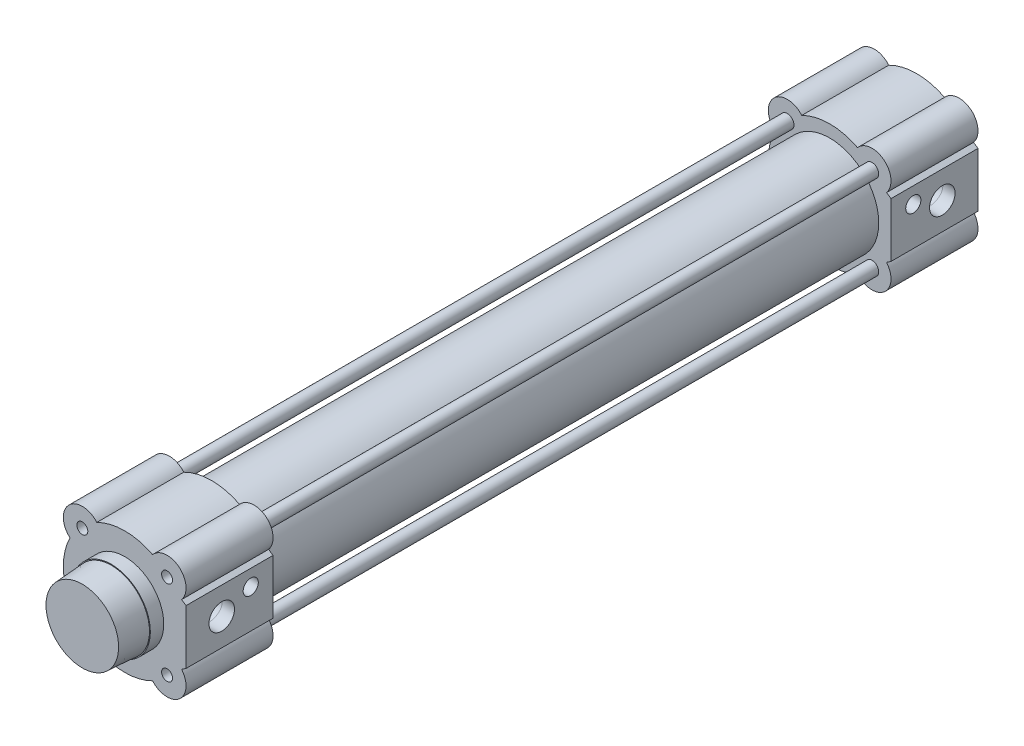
ISO-10303-21;
HEADER;
FILE_DESCRIPTION(('STEP AP214'),'2;1');
FILE_NAME('part.step','',(''),(''),'','','');
FILE_SCHEMA(('AUTOMOTIVE_DESIGN { 1 0 10303 214 1 1 1 1 }'));
ENDSEC;
DATA;
#1=APPLICATION_CONTEXT('core data for automotive mechanical design processes');
#2=APPLICATION_PROTOCOL_DEFINITION('international standard','automotive_design',2000,#1);
#3=PRODUCT_CONTEXT('',#1,'mechanical');
#4=PRODUCT('Part','Part','',(#3));
#5=PRODUCT_RELATED_PRODUCT_CATEGORY('part','',(#4));
#6=PRODUCT_DEFINITION_FORMATION('','',#4);
#7=PRODUCT_DEFINITION_CONTEXT('part definition',#1,'design');
#8=PRODUCT_DEFINITION('design','',#6,#7);
#9=PRODUCT_DEFINITION_SHAPE('','',#8);
#10=(LENGTH_UNIT() NAMED_UNIT(*) SI_UNIT(.MILLI.,.METRE.));
#11=(NAMED_UNIT(*) PLANE_ANGLE_UNIT() SI_UNIT($,.RADIAN.));
#12=(NAMED_UNIT(*) SI_UNIT($,.STERADIAN.) SOLID_ANGLE_UNIT());
#13=UNCERTAINTY_MEASURE_WITH_UNIT(LENGTH_MEASURE(1.E-05),#10,'distance_accuracy_value','');
#14=(GEOMETRIC_REPRESENTATION_CONTEXT(3) GLOBAL_UNCERTAINTY_ASSIGNED_CONTEXT((#13)) GLOBAL_UNIT_ASSIGNED_CONTEXT((#10,
#11,#12)) REPRESENTATION_CONTEXT('',''));
#15=CARTESIAN_POINT('',(0.,0.,0.));
#16=DIRECTION('',(0.,0.,1.));
#17=DIRECTION('',(1.,0.,0.));
#18=AXIS2_PLACEMENT_3D('',#15,#16,#17);
#19=CARTESIAN_POINT('',(0.,0.,-3.9));
#20=DIRECTION('',(0.,0.,-1.));
#21=DIRECTION('',(0.,-1.,0.));
#22=AXIS2_PLACEMENT_3D('',#19,#20,#21);
#23=CYLINDRICAL_SURFACE('',#22,22.);
#24=CARTESIAN_POINT('',(0.,0.,-316.));
#25=DIRECTION('',(0.,0.,1.));
#26=DIRECTION('',(1.,0.,0.));
#27=AXIS2_PLACEMENT_3D('',#24,#25,#26);
#28=CIRCLE('',#27,22.);
#29=CARTESIAN_POINT('',(22.,0.,-316.));
#30=VERTEX_POINT('',#29);
#31=EDGE_CURVE('E10',#30,#30,#28,.F.);
#32=ORIENTED_EDGE('',*,*,#31,.F.);
#33=EDGE_LOOP('',(#32));
#34=FACE_BOUND('',#33,.T.);
#35=CARTESIAN_POINT('',(0.,0.,-39.));
#36=DIRECTION('',(0.,0.,1.));
#37=DIRECTION('',(1.,0.,0.));
#38=AXIS2_PLACEMENT_3D('',#35,#36,#37);
#39=CIRCLE('',#38,22.);
#40=CARTESIAN_POINT('',(22.,0.,-39.));
#41=VERTEX_POINT('',#40);
#42=EDGE_CURVE('E397',#41,#41,#39,.F.);
#43=ORIENTED_EDGE('',*,*,#42,.T.);
#44=EDGE_LOOP('',(#43));
#45=FACE_BOUND('',#44,.T.);
#46=ADVANCED_FACE('F16',(#34,#45),#23,.T.);
#47=CARTESIAN_POINT('',(-19.,-19.,-39.));
#48=DIRECTION('',(0.,0.,1.));
#49=DIRECTION('',(1.,0.,0.));
#50=AXIS2_PLACEMENT_3D('',#47,#48,#49);
#51=CYLINDRICAL_SURFACE('',#50,8.5);
#52=CARTESIAN_POINT('',(-19.,-19.,0.));
#53=DIRECTION('',(0.,0.,1.));
#54=DIRECTION('',(1.,0.,0.));
#55=AXIS2_PLACEMENT_3D('',#52,#53,#54);
#56=CIRCLE('',#55,8.5);
#57=CARTESIAN_POINT('',(-24.4895742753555,-12.5104257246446,0.));
#58=VERTEX_POINT('',#57);
#59=CARTESIAN_POINT('',(-12.5104257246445,-24.4895742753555,0.));
#60=VERTEX_POINT('',#59);
#61=EDGE_CURVE('E581',#58,#60,#56,.T.);
#62=ORIENTED_EDGE('',*,*,#61,.F.);
#63=DIRECTION('',(0.,0.,1.));
#64=VECTOR('',#63,1.);
#65=CARTESIAN_POINT('',(-24.4895742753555,-12.5104257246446,-39.));
#66=LINE('',#65,#64);
#67=CARTESIAN_POINT('',(-24.4895742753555,-12.5104257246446,-39.));
#68=VERTEX_POINT('',#67);
#69=EDGE_CURVE('E33',#68,#58,#66,.T.);
#70=ORIENTED_EDGE('',*,*,#69,.F.);
#71=CARTESIAN_POINT('',(-19.,-19.,-39.));
#72=DIRECTION('',(0.,0.,1.));
#73=DIRECTION('',(1.,0.,0.));
#74=AXIS2_PLACEMENT_3D('',#71,#72,#73);
#75=CIRCLE('',#74,8.5);
#76=CARTESIAN_POINT('',(-12.5104257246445,-24.4895742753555,-39.));
#77=VERTEX_POINT('',#76);
#78=EDGE_CURVE('E547',#68,#77,#75,.T.);
#79=ORIENTED_EDGE('',*,*,#78,.T.);
#80=DIRECTION('',(0.,0.,1.));
#81=VECTOR('',#80,1.);
#82=CARTESIAN_POINT('',(-12.5104257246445,-24.4895742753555,-39.));
#83=LINE('',#82,#81);
#84=EDGE_CURVE('E391',#77,#60,#83,.T.);
#85=ORIENTED_EDGE('',*,*,#84,.T.);
#86=EDGE_LOOP('',(#62,#70,#79,#85));
#87=FACE_BOUND('',#86,.T.);
#88=ADVANCED_FACE('F527',(#87),#51,.T.);
#89=CARTESIAN_POINT('',(0.,0.,-39.));
#90=DIRECTION('',(0.,0.,1.));
#91=DIRECTION('',(1.,0.,0.));
#92=AXIS2_PLACEMENT_3D('',#89,#90,#91);
#93=CYLINDRICAL_SURFACE('',#92,27.5);
#94=CARTESIAN_POINT('',(0.,0.,0.));
#95=DIRECTION('',(0.,0.,1.));
#96=DIRECTION('',(1.,0.,0.));
#97=AXIS2_PLACEMENT_3D('',#94,#95,#96);
#98=CIRCLE('',#97,27.5);
#99=CARTESIAN_POINT('',(12.5104257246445,-24.4895742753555,0.));
#100=VERTEX_POINT('',#99);
#101=EDGE_CURVE('E583',#60,#100,#98,.T.);
#102=ORIENTED_EDGE('',*,*,#101,.F.);
#103=ORIENTED_EDGE('',*,*,#84,.F.);
#104=CARTESIAN_POINT('',(0.,0.,-39.));
#105=DIRECTION('',(0.,0.,1.));
#106=DIRECTION('',(1.,0.,0.));
#107=AXIS2_PLACEMENT_3D('',#104,#105,#106);
#108=CIRCLE('',#107,27.5);
#109=CARTESIAN_POINT('',(12.5104257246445,-24.4895742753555,-39.));
#110=VERTEX_POINT('',#109);
#111=EDGE_CURVE('E552',#77,#110,#108,.T.);
#112=ORIENTED_EDGE('',*,*,#111,.T.);
#113=DIRECTION('',(0.,0.,1.));
#114=VECTOR('',#113,1.);
#115=CARTESIAN_POINT('',(12.5104257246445,-24.4895742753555,-39.));
#116=LINE('',#115,#114);
#117=EDGE_CURVE('E576',#110,#100,#116,.T.);
#118=ORIENTED_EDGE('',*,*,#117,.T.);
#119=EDGE_LOOP('',(#102,#103,#112,#118));
#120=FACE_BOUND('',#119,.T.);
#121=ADVANCED_FACE('F532',(#120),#93,.T.);
#122=CARTESIAN_POINT('',(19.,-19.,-39.));
#123=DIRECTION('',(0.,0.,1.));
#124=DIRECTION('',(1.,0.,0.));
#125=AXIS2_PLACEMENT_3D('',#122,#123,#124);
#126=CYLINDRICAL_SURFACE('',#125,8.5);
#127=CARTESIAN_POINT('',(19.,-19.,0.));
#128=DIRECTION('',(0.,0.,1.));
#129=DIRECTION('',(1.,0.,0.));
#130=AXIS2_PLACEMENT_3D('',#127,#128,#129);
#131=CIRCLE('',#130,8.5);
#132=CARTESIAN_POINT('',(25.5113777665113,-13.5363053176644,0.));
#133=VERTEX_POINT('',#132);
#134=EDGE_CURVE('E586',#100,#133,#131,.T.);
#135=ORIENTED_EDGE('',*,*,#134,.F.);
#136=ORIENTED_EDGE('',*,*,#117,.F.);
#137=CARTESIAN_POINT('',(19.,-19.,-39.));
#138=DIRECTION('',(0.,0.,1.));
#139=DIRECTION('',(1.,0.,0.));
#140=AXIS2_PLACEMENT_3D('',#137,#138,#139);
#141=CIRCLE('',#140,8.5);
#142=CARTESIAN_POINT('',(25.5113777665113,-13.5363053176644,-39.));
#143=VERTEX_POINT('',#142);
#144=EDGE_CURVE('E555',#110,#143,#141,.T.);
#145=ORIENTED_EDGE('',*,*,#144,.T.);
#146=DIRECTION('',(0.,0.,1.));
#147=VECTOR('',#146,1.);
#148=CARTESIAN_POINT('',(25.5113777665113,-13.5363053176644,-39.));
#149=LINE('',#148,#147);
#150=EDGE_CURVE('E575',#143,#133,#149,.T.);
#151=ORIENTED_EDGE('',*,*,#150,.T.);
#152=EDGE_LOOP('',(#135,#136,#145,#151));
#153=FACE_BOUND('',#152,.T.);
#154=ADVANCED_FACE('F729',(#153),#126,.T.);
#155=CARTESIAN_POINT('',(27.5,-12.2,-39.));
#156=DIRECTION('',(-0.557747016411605,0.830011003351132,0.));
#157=DIRECTION('',(-0.830011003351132,-0.557747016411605,0.));
#158=AXIS2_PLACEMENT_3D('',#155,#156,#157);
#159=PLANE('',#158);
#160=DIRECTION('',(-0.830011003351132,-0.557747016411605,0.));
#161=VECTOR('',#160,1.);
#162=CARTESIAN_POINT('',(27.5,-12.2,0.));
#163=LINE('',#162,#161);
#164=CARTESIAN_POINT('',(27.5,-12.2,0.));
#165=VERTEX_POINT('',#164);
#166=EDGE_CURVE('E629',#165,#133,#163,.T.);
#167=ORIENTED_EDGE('',*,*,#166,.T.);
#168=ORIENTED_EDGE('',*,*,#150,.F.);
#169=DIRECTION('',(-0.830011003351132,-0.557747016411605,0.));
#170=VECTOR('',#169,1.);
#171=CARTESIAN_POINT('',(27.5,-12.2,-39.));
#172=LINE('',#171,#170);
#173=CARTESIAN_POINT('',(27.5,-12.2,-39.));
#174=VERTEX_POINT('',#173);
#175=EDGE_CURVE('E598',#174,#143,#172,.T.);
#176=ORIENTED_EDGE('',*,*,#175,.F.);
#177=DIRECTION('',(0.,0.,1.));
#178=VECTOR('',#177,1.);
#179=CARTESIAN_POINT('',(27.5,-12.2,-39.));
#180=LINE('',#179,#178);
#181=EDGE_CURVE('E573',#174,#165,#180,.T.);
#182=ORIENTED_EDGE('',*,*,#181,.T.);
#183=EDGE_LOOP('',(#167,#168,#176,#182));
#184=FACE_BOUND('',#183,.T.);
#185=ADVANCED_FACE('F725',(#184),#159,.F.);
#186=CARTESIAN_POINT('',(27.5,12.2,-39.));
#187=DIRECTION('',(-1.,0.,0.));
#188=DIRECTION('',(0.,-1.,0.));
#189=AXIS2_PLACEMENT_3D('',#186,#187,#188);
#190=PLANE('',#189);
#191=CARTESIAN_POINT('',(27.5,5.,-29.));
#192=DIRECTION('',(-1.,0.,0.));
#193=DIRECTION('',(0.,1.,0.));
#194=AXIS2_PLACEMENT_3D('',#191,#192,#193);
#195=CIRCLE('',#194,3.4);
#196=CARTESIAN_POINT('',(27.5,8.4,-29.));
#197=VERTEX_POINT('',#196);
#198=EDGE_CURVE('E656',#197,#197,#195,.T.);
#199=ORIENTED_EDGE('',*,*,#198,.T.);
#200=EDGE_LOOP('',(#199));
#201=FACE_BOUND('',#200,.T.);
#202=CARTESIAN_POINT('',(27.5,0.,-16.));
#203=DIRECTION('',(-1.,0.,0.));
#204=DIRECTION('',(0.,1.,0.));
#205=AXIS2_PLACEMENT_3D('',#202,#203,#204);
#206=CIRCLE('',#205,5.7225);
#207=CARTESIAN_POINT('',(27.5,5.7225,-16.));
#208=VERTEX_POINT('',#207);
#209=EDGE_CURVE('E653',#208,#208,#206,.T.);
#210=ORIENTED_EDGE('',*,*,#209,.T.);
#211=EDGE_LOOP('',(#210));
#212=FACE_BOUND('',#211,.T.);
#213=DIRECTION('',(0.,-1.,0.));
#214=VECTOR('',#213,1.);
#215=CARTESIAN_POINT('',(27.5,12.2,0.));
#216=LINE('',#215,#214);
#217=CARTESIAN_POINT('',(27.5,12.2,0.));
#218=VERTEX_POINT('',#217);
#219=EDGE_CURVE('E626',#218,#165,#216,.T.);
#220=ORIENTED_EDGE('',*,*,#219,.T.);
#221=ORIENTED_EDGE('',*,*,#181,.F.);
#222=DIRECTION('',(0.,-1.,0.));
#223=VECTOR('',#222,1.);
#224=CARTESIAN_POINT('',(27.5,12.2,-39.));
#225=LINE('',#224,#223);
#226=CARTESIAN_POINT('',(27.5,12.2,-39.));
#227=VERTEX_POINT('',#226);
#228=EDGE_CURVE('E601',#227,#174,#225,.T.);
#229=ORIENTED_EDGE('',*,*,#228,.F.);
#230=DIRECTION('',(0.,0.,1.));
#231=VECTOR('',#230,1.);
#232=CARTESIAN_POINT('',(27.5,12.2,-39.));
#233=LINE('',#232,#231);
#234=EDGE_CURVE('E571',#227,#218,#233,.T.);
#235=ORIENTED_EDGE('',*,*,#234,.T.);
#236=EDGE_LOOP('',(#220,#221,#229,#235));
#237=FACE_BOUND('',#236,.T.);
#238=ADVANCED_FACE('F721',(#201,#212,#237),#190,.F.);
#239=CARTESIAN_POINT('',(25.5113777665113,13.5363053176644,-39.));
#240=DIRECTION('',(-0.557747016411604,-0.830011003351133,0.));
#241=DIRECTION('',(0.830011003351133,-0.557747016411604,0.));
#242=AXIS2_PLACEMENT_3D('',#239,#240,#241);
#243=PLANE('',#242);
#244=DIRECTION('',(0.830011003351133,-0.557747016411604,0.));
#245=VECTOR('',#244,1.);
#246=CARTESIAN_POINT('',(25.5113777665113,13.5363053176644,0.));
#247=LINE('',#246,#245);
#248=CARTESIAN_POINT('',(25.5113777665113,13.5363053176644,0.));
#249=VERTEX_POINT('',#248);
#250=EDGE_CURVE('E623',#249,#218,#247,.T.);
#251=ORIENTED_EDGE('',*,*,#250,.T.);
#252=ORIENTED_EDGE('',*,*,#234,.F.);
#253=DIRECTION('',(0.830011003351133,-0.557747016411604,0.));
#254=VECTOR('',#253,1.);
#255=CARTESIAN_POINT('',(25.5113777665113,13.5363053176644,-39.));
#256=LINE('',#255,#254);
#257=CARTESIAN_POINT('',(25.5113777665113,13.5363053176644,-39.));
#258=VERTEX_POINT('',#257);
#259=EDGE_CURVE('E604',#258,#227,#256,.T.);
#260=ORIENTED_EDGE('',*,*,#259,.F.);
#261=DIRECTION('',(0.,0.,1.));
#262=VECTOR('',#261,1.);
#263=CARTESIAN_POINT('',(25.5113777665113,13.5363053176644,-39.));
#264=LINE('',#263,#262);
#265=EDGE_CURVE('E569',#258,#249,#264,.T.);
#266=ORIENTED_EDGE('',*,*,#265,.T.);
#267=EDGE_LOOP('',(#251,#252,#260,#266));
#268=FACE_BOUND('',#267,.T.);
#269=ADVANCED_FACE('F717',(#268),#243,.F.);
#270=CARTESIAN_POINT('',(19.,19.,-39.));
#271=DIRECTION('',(0.,0.,1.));
#272=DIRECTION('',(1.,0.,0.));
#273=AXIS2_PLACEMENT_3D('',#270,#271,#272);
#274=CYLINDRICAL_SURFACE('',#273,8.5);
#275=CARTESIAN_POINT('',(19.,19.,0.));
#276=DIRECTION('',(0.,0.,1.));
#277=DIRECTION('',(1.,0.,0.));
#278=AXIS2_PLACEMENT_3D('',#275,#276,#277);
#279=CIRCLE('',#278,8.5);
#280=CARTESIAN_POINT('',(12.5104257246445,24.4895742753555,0.));
#281=VERTEX_POINT('',#280);
#282=EDGE_CURVE('E619',#249,#281,#279,.T.);
#283=ORIENTED_EDGE('',*,*,#282,.F.);
#284=ORIENTED_EDGE('',*,*,#265,.F.);
#285=CARTESIAN_POINT('',(19.,19.,-39.));
#286=DIRECTION('',(0.,0.,1.));
#287=DIRECTION('',(1.,0.,0.));
#288=AXIS2_PLACEMENT_3D('',#285,#286,#287);
#289=CIRCLE('',#288,8.5);
#290=CARTESIAN_POINT('',(12.5104257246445,24.4895742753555,-39.));
#291=VERTEX_POINT('',#290);
#292=EDGE_CURVE('E607',#258,#291,#289,.T.);
#293=ORIENTED_EDGE('',*,*,#292,.T.);
#294=DIRECTION('',(0.,0.,1.));
#295=VECTOR('',#294,1.);
#296=CARTESIAN_POINT('',(12.5104257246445,24.4895742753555,-39.));
#297=LINE('',#296,#295);
#298=EDGE_CURVE('E567',#291,#281,#297,.T.);
#299=ORIENTED_EDGE('',*,*,#298,.T.);
#300=EDGE_LOOP('',(#283,#284,#293,#299));
#301=FACE_BOUND('',#300,.T.);
#302=ADVANCED_FACE('F713',(#301),#274,.T.);
#303=CARTESIAN_POINT('',(0.,0.,-39.));
#304=DIRECTION('',(0.,0.,1.));
#305=DIRECTION('',(1.,0.,0.));
#306=AXIS2_PLACEMENT_3D('',#303,#304,#305);
#307=CYLINDRICAL_SURFACE('',#306,27.5);
#308=CARTESIAN_POINT('',(0.,0.,0.));
#309=DIRECTION('',(0.,0.,1.));
#310=DIRECTION('',(1.,0.,0.));
#311=AXIS2_PLACEMENT_3D('',#308,#309,#310);
#312=CIRCLE('',#311,27.5);
#313=CARTESIAN_POINT('',(-12.5104257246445,24.4895742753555,0.));
#314=VERTEX_POINT('',#313);
#315=EDGE_CURVE('E618',#281,#314,#312,.T.);
#316=ORIENTED_EDGE('',*,*,#315,.F.);
#317=ORIENTED_EDGE('',*,*,#298,.F.);
#318=CARTESIAN_POINT('',(0.,0.,-39.));
#319=DIRECTION('',(0.,0.,1.));
#320=DIRECTION('',(1.,0.,0.));
#321=AXIS2_PLACEMENT_3D('',#318,#319,#320);
#322=CIRCLE('',#321,27.5);
#323=CARTESIAN_POINT('',(-12.5104257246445,24.4895742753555,-39.));
#324=VERTEX_POINT('',#323);
#325=EDGE_CURVE('E610',#291,#324,#322,.T.);
#326=ORIENTED_EDGE('',*,*,#325,.T.);
#327=DIRECTION('',(0.,0.,1.));
#328=VECTOR('',#327,1.);
#329=CARTESIAN_POINT('',(-12.5104257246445,24.4895742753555,-39.));
#330=LINE('',#329,#328);
#331=EDGE_CURVE('E565',#324,#314,#330,.T.);
#332=ORIENTED_EDGE('',*,*,#331,.T.);
#333=EDGE_LOOP('',(#316,#317,#326,#332));
#334=FACE_BOUND('',#333,.T.);
#335=ADVANCED_FACE('F710',(#334),#307,.T.);
#336=CARTESIAN_POINT('',(-19.,19.,-39.));
#337=DIRECTION('',(0.,0.,1.));
#338=DIRECTION('',(1.,0.,0.));
#339=AXIS2_PLACEMENT_3D('',#336,#337,#338);
#340=CYLINDRICAL_SURFACE('',#339,8.5);
#341=CARTESIAN_POINT('',(-19.,19.,0.));
#342=DIRECTION('',(0.,0.,1.));
#343=DIRECTION('',(1.,0.,0.));
#344=AXIS2_PLACEMENT_3D('',#341,#342,#343);
#345=CIRCLE('',#344,8.5);
#346=CARTESIAN_POINT('',(-24.4895742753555,12.5104257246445,0.));
#347=VERTEX_POINT('',#346);
#348=EDGE_CURVE('E558',#314,#347,#345,.T.);
#349=ORIENTED_EDGE('',*,*,#348,.F.);
#350=ORIENTED_EDGE('',*,*,#331,.F.);
#351=CARTESIAN_POINT('',(-19.,19.,-39.));
#352=DIRECTION('',(0.,0.,1.));
#353=DIRECTION('',(1.,0.,0.));
#354=AXIS2_PLACEMENT_3D('',#351,#352,#353);
#355=CIRCLE('',#354,8.5);
#356=CARTESIAN_POINT('',(-24.4895742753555,12.5104257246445,-39.));
#357=VERTEX_POINT('',#356);
#358=EDGE_CURVE('E612',#324,#357,#355,.T.);
#359=ORIENTED_EDGE('',*,*,#358,.T.);
#360=DIRECTION('',(0.,0.,1.));
#361=VECTOR('',#360,1.);
#362=CARTESIAN_POINT('',(-24.4895742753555,12.5104257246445,-39.));
#363=LINE('',#362,#361);
#364=EDGE_CURVE('E40',#357,#347,#363,.T.);
#365=ORIENTED_EDGE('',*,*,#364,.T.);
#366=EDGE_LOOP('',(#349,#350,#359,#365));
#367=FACE_BOUND('',#366,.T.);
#368=ADVANCED_FACE('F707',(#367),#340,.T.);
#369=CARTESIAN_POINT('',(0.,0.,-39.));
#370=DIRECTION('',(0.,0.,1.));
#371=DIRECTION('',(1.,0.,0.));
#372=AXIS2_PLACEMENT_3D('',#369,#370,#371);
#373=CYLINDRICAL_SURFACE('',#372,27.5);
#374=CARTESIAN_POINT('',(0.,0.,0.));
#375=DIRECTION('',(0.,0.,1.));
#376=DIRECTION('',(1.,0.,0.));
#377=AXIS2_PLACEMENT_3D('',#374,#375,#376);
#378=CIRCLE('',#377,27.5);
#379=EDGE_CURVE('E553',#347,#58,#378,.T.);
#380=ORIENTED_EDGE('',*,*,#379,.F.);
#381=ORIENTED_EDGE('',*,*,#364,.F.);
#382=CARTESIAN_POINT('',(0.,0.,-39.));
#383=DIRECTION('',(0.,0.,1.));
#384=DIRECTION('',(1.,0.,0.));
#385=AXIS2_PLACEMENT_3D('',#382,#383,#384);
#386=CIRCLE('',#385,27.5);
#387=EDGE_CURVE('E549',#357,#68,#386,.T.);
#388=ORIENTED_EDGE('',*,*,#387,.T.);
#389=ORIENTED_EDGE('',*,*,#69,.T.);
#390=EDGE_LOOP('',(#380,#381,#388,#389));
#391=FACE_BOUND('',#390,.T.);
#392=ADVANCED_FACE('F542',(#391),#373,.T.);
#393=CARTESIAN_POINT('',(-19.,-19.,-39.));
#394=DIRECTION('',(0.,0.,1.));
#395=DIRECTION('',(1.,0.,0.));
#396=AXIS2_PLACEMENT_3D('',#393,#394,#395);
#397=PLANE('',#396);
#398=CARTESIAN_POINT('',(19.,19.,-39.));
#399=DIRECTION('',(0.,0.,1.));
#400=DIRECTION('',(1.,0.,0.));
#401=AXIS2_PLACEMENT_3D('',#398,#399,#400);
#402=CIRCLE('',#401,3.);
#403=CARTESIAN_POINT('',(22.,19.,-39.));
#404=VERTEX_POINT('',#403);
#405=EDGE_CURVE('E425',#404,#404,#402,.T.);
#406=ORIENTED_EDGE('',*,*,#405,.T.);
#407=EDGE_LOOP('',(#406));
#408=FACE_BOUND('',#407,.T.);
#409=CARTESIAN_POINT('',(-19.,19.,-39.));
#410=DIRECTION('',(0.,0.,1.));
#411=DIRECTION('',(1.,0.,0.));
#412=AXIS2_PLACEMENT_3D('',#409,#410,#411);
#413=CIRCLE('',#412,3.);
#414=CARTESIAN_POINT('',(-16.,19.,-39.));
#415=VERTEX_POINT('',#414);
#416=EDGE_CURVE('E423',#415,#415,#413,.T.);
#417=ORIENTED_EDGE('',*,*,#416,.T.);
#418=EDGE_LOOP('',(#417));
#419=FACE_BOUND('',#418,.T.);
#420=CARTESIAN_POINT('',(19.,-19.,-39.));
#421=DIRECTION('',(0.,0.,1.));
#422=DIRECTION('',(1.,0.,0.));
#423=AXIS2_PLACEMENT_3D('',#420,#421,#422);
#424=CIRCLE('',#423,3.);
#425=CARTESIAN_POINT('',(22.,-19.,-39.));
#426=VERTEX_POINT('',#425);
#427=EDGE_CURVE('E420',#426,#426,#424,.T.);
#428=ORIENTED_EDGE('',*,*,#427,.T.);
#429=EDGE_LOOP('',(#428));
#430=FACE_BOUND('',#429,.T.);
#431=CARTESIAN_POINT('',(-19.,-19.,-39.));
#432=DIRECTION('',(0.,0.,1.));
#433=DIRECTION('',(1.,0.,0.));
#434=AXIS2_PLACEMENT_3D('',#431,#432,#433);
#435=CIRCLE('',#434,3.);
#436=CARTESIAN_POINT('',(-16.,-19.,-39.));
#437=VERTEX_POINT('',#436);
#438=EDGE_CURVE('E416',#437,#437,#435,.T.);
#439=ORIENTED_EDGE('',*,*,#438,.T.);
#440=EDGE_LOOP('',(#439));
#441=FACE_BOUND('',#440,.T.);
#442=ORIENTED_EDGE('',*,*,#42,.F.);
#443=EDGE_LOOP('',(#442));
#444=FACE_BOUND('',#443,.T.);
#445=ORIENTED_EDGE('',*,*,#78,.F.);
#446=ORIENTED_EDGE('',*,*,#387,.F.);
#447=ORIENTED_EDGE('',*,*,#358,.F.);
#448=ORIENTED_EDGE('',*,*,#325,.F.);
#449=ORIENTED_EDGE('',*,*,#292,.F.);
#450=ORIENTED_EDGE('',*,*,#259,.T.);
#451=ORIENTED_EDGE('',*,*,#228,.T.);
#452=ORIENTED_EDGE('',*,*,#175,.T.);
#453=ORIENTED_EDGE('',*,*,#144,.F.);
#454=ORIENTED_EDGE('',*,*,#111,.F.);
#455=EDGE_LOOP('',(#445,#446,#447,#448,#449,#450,#451,#452,#453,#454));
#456=FACE_BOUND('',#455,.T.);
#457=ADVANCED_FACE('F538',(#408,#419,#430,#441,#444,#456),#397,.F.);
#458=CARTESIAN_POINT('',(-19.,-19.,0.));
#459=DIRECTION('',(0.,0.,1.));
#460=DIRECTION('',(1.,0.,0.));
#461=AXIS2_PLACEMENT_3D('',#458,#459,#460);
#462=PLANE('',#461);
#463=CARTESIAN_POINT('',(0.,0.,0.));
#464=DIRECTION('',(0.,0.,1.));
#465=DIRECTION('',(1.,0.,0.));
#466=AXIS2_PLACEMENT_3D('',#463,#464,#465);
#467=CIRCLE('',#466,17.5);
#468=CARTESIAN_POINT('',(17.5,0.,0.));
#469=VERTEX_POINT('',#468);
#470=EDGE_CURVE('E410',#469,#469,#467,.T.);
#471=ORIENTED_EDGE('',*,*,#470,.F.);
#472=EDGE_LOOP('',(#471));
#473=FACE_BOUND('',#472,.T.);
#474=CARTESIAN_POINT('',(-19.,-19.,0.));
#475=DIRECTION('',(0.,0.,-1.));
#476=DIRECTION('',(0.,-1.,0.));
#477=AXIS2_PLACEMENT_3D('',#474,#475,#476);
#478=CIRCLE('',#477,2.45875);
#479=CARTESIAN_POINT('',(-19.,-21.45875,0.));
#480=VERTEX_POINT('',#479);
#481=EDGE_CURVE('E650',#480,#480,#478,.T.);
#482=ORIENTED_EDGE('',*,*,#481,.T.);
#483=EDGE_LOOP('',(#482));
#484=FACE_BOUND('',#483,.T.);
#485=CARTESIAN_POINT('',(19.,-19.,0.));
#486=DIRECTION('',(0.,0.,-1.));
#487=DIRECTION('',(0.,-1.,0.));
#488=AXIS2_PLACEMENT_3D('',#485,#486,#487);
#489=CIRCLE('',#488,2.45875);
#490=CARTESIAN_POINT('',(19.,-21.45875,0.));
#491=VERTEX_POINT('',#490);
#492=EDGE_CURVE('E644',#491,#491,#489,.T.);
#493=ORIENTED_EDGE('',*,*,#492,.T.);
#494=EDGE_LOOP('',(#493));
#495=FACE_BOUND('',#494,.T.);
#496=CARTESIAN_POINT('',(-19.,19.,0.));
#497=DIRECTION('',(0.,0.,-1.));
#498=DIRECTION('',(0.,-1.,0.));
#499=AXIS2_PLACEMENT_3D('',#496,#497,#498);
#500=CIRCLE('',#499,2.45875);
#501=CARTESIAN_POINT('',(-19.,16.54125,0.));
#502=VERTEX_POINT('',#501);
#503=EDGE_CURVE('E638',#502,#502,#500,.T.);
#504=ORIENTED_EDGE('',*,*,#503,.T.);
#505=EDGE_LOOP('',(#504));
#506=FACE_BOUND('',#505,.T.);
#507=CARTESIAN_POINT('',(19.,19.,0.));
#508=DIRECTION('',(0.,0.,-1.));
#509=DIRECTION('',(0.,-1.,0.));
#510=AXIS2_PLACEMENT_3D('',#507,#508,#509);
#511=CIRCLE('',#510,2.45875);
#512=CARTESIAN_POINT('',(19.,16.54125,0.));
#513=VERTEX_POINT('',#512);
#514=EDGE_CURVE('E592',#513,#513,#511,.T.);
#515=ORIENTED_EDGE('',*,*,#514,.T.);
#516=EDGE_LOOP('',(#515));
#517=FACE_BOUND('',#516,.T.);
#518=ORIENTED_EDGE('',*,*,#61,.T.);
#519=ORIENTED_EDGE('',*,*,#101,.T.);
#520=ORIENTED_EDGE('',*,*,#134,.T.);
#521=ORIENTED_EDGE('',*,*,#166,.F.);
#522=ORIENTED_EDGE('',*,*,#219,.F.);
#523=ORIENTED_EDGE('',*,*,#250,.F.);
#524=ORIENTED_EDGE('',*,*,#282,.T.);
#525=ORIENTED_EDGE('',*,*,#315,.T.);
#526=ORIENTED_EDGE('',*,*,#348,.T.);
#527=ORIENTED_EDGE('',*,*,#379,.T.);
#528=EDGE_LOOP('',(#518,#519,#520,#521,#522,#523,#524,#525,#526,#527));
#529=FACE_BOUND('',#528,.T.);
#530=ADVANCED_FACE('F541',(#473,#484,#495,#506,#517,#529),#462,.T.);
#531=CARTESIAN_POINT('',(19.,19.,-16.));
#532=DIRECTION('',(0.,0.,-1.));
#533=DIRECTION('',(-1.,0.,0.));
#534=AXIS2_PLACEMENT_3D('',#531,#532,#533);
#535=PLANE('',#534);
#536=CARTESIAN_POINT('',(19.,19.,-16.));
#537=DIRECTION('',(0.,0.,1.));
#538=DIRECTION('',(0.,-1.,0.));
#539=AXIS2_PLACEMENT_3D('',#536,#537,#538);
#540=CIRCLE('',#539,2.45875);
#541=CARTESIAN_POINT('',(19.,16.54125,-16.));
#542=VERTEX_POINT('',#541);
#543=EDGE_CURVE('E589',#542,#542,#540,.T.);
#544=ORIENTED_EDGE('',*,*,#543,.T.);
#545=EDGE_LOOP('',(#544));
#546=FACE_BOUND('',#545,.T.);
#547=ADVANCED_FACE('F678',(#546),#535,.F.);
#548=CARTESIAN_POINT('',(19.,19.,0.));
#549=DIRECTION('',(0.,0.,-1.));
#550=DIRECTION('',(0.,-1.,0.));
#551=AXIS2_PLACEMENT_3D('',#548,#549,#550);
#552=CYLINDRICAL_SURFACE('',#551,2.45875);
#553=ORIENTED_EDGE('',*,*,#543,.F.);
#554=EDGE_LOOP('',(#553));
#555=FACE_BOUND('',#554,.T.);
#556=ORIENTED_EDGE('',*,*,#514,.F.);
#557=EDGE_LOOP('',(#556));
#558=FACE_BOUND('',#557,.T.);
#559=ADVANCED_FACE('F688',(#555,#558),#552,.F.);
#560=CARTESIAN_POINT('',(-19.,19.,-16.));
#561=DIRECTION('',(0.,0.,-1.));
#562=DIRECTION('',(-1.,0.,0.));
#563=AXIS2_PLACEMENT_3D('',#560,#561,#562);
#564=PLANE('',#563);
#565=CARTESIAN_POINT('',(-19.,19.,-16.));
#566=DIRECTION('',(0.,0.,1.));
#567=DIRECTION('',(0.,-1.,0.));
#568=AXIS2_PLACEMENT_3D('',#565,#566,#567);
#569=CIRCLE('',#568,2.45875);
#570=CARTESIAN_POINT('',(-19.,16.54125,-16.));
#571=VERTEX_POINT('',#570);
#572=EDGE_CURVE('E635',#571,#571,#569,.T.);
#573=ORIENTED_EDGE('',*,*,#572,.T.);
#574=EDGE_LOOP('',(#573));
#575=FACE_BOUND('',#574,.T.);
#576=ADVANCED_FACE('F690',(#575),#564,.F.);
#577=CARTESIAN_POINT('',(-19.,19.,0.));
#578=DIRECTION('',(0.,0.,-1.));
#579=DIRECTION('',(0.,-1.,0.));
#580=AXIS2_PLACEMENT_3D('',#577,#578,#579);
#581=CYLINDRICAL_SURFACE('',#580,2.45875);
#582=ORIENTED_EDGE('',*,*,#572,.F.);
#583=EDGE_LOOP('',(#582));
#584=FACE_BOUND('',#583,.T.);
#585=ORIENTED_EDGE('',*,*,#503,.F.);
#586=EDGE_LOOP('',(#585));
#587=FACE_BOUND('',#586,.T.);
#588=ADVANCED_FACE('F697',(#584,#587),#581,.F.);
#589=CARTESIAN_POINT('',(19.,-19.,-16.));
#590=DIRECTION('',(0.,0.,-1.));
#591=DIRECTION('',(-1.,0.,0.));
#592=AXIS2_PLACEMENT_3D('',#589,#590,#591);
#593=PLANE('',#592);
#594=CARTESIAN_POINT('',(19.,-19.,-16.));
#595=DIRECTION('',(0.,0.,1.));
#596=DIRECTION('',(0.,-1.,0.));
#597=AXIS2_PLACEMENT_3D('',#594,#595,#596);
#598=CIRCLE('',#597,2.45875);
#599=CARTESIAN_POINT('',(19.,-21.45875,-16.));
#600=VERTEX_POINT('',#599);
#601=EDGE_CURVE('E641',#600,#600,#598,.T.);
#602=ORIENTED_EDGE('',*,*,#601,.T.);
#603=EDGE_LOOP('',(#602));
#604=FACE_BOUND('',#603,.T.);
#605=ADVANCED_FACE('F796',(#604),#593,.F.);
#606=CARTESIAN_POINT('',(19.,-19.,0.));
#607=DIRECTION('',(0.,0.,-1.));
#608=DIRECTION('',(0.,-1.,0.));
#609=AXIS2_PLACEMENT_3D('',#606,#607,#608);
#610=CYLINDRICAL_SURFACE('',#609,2.45875);
#611=ORIENTED_EDGE('',*,*,#601,.F.);
#612=EDGE_LOOP('',(#611));
#613=FACE_BOUND('',#612,.T.);
#614=ORIENTED_EDGE('',*,*,#492,.F.);
#615=EDGE_LOOP('',(#614));
#616=FACE_BOUND('',#615,.T.);
#617=ADVANCED_FACE('F791',(#613,#616),#610,.F.);
#618=CARTESIAN_POINT('',(-19.,-19.,-16.));
#619=DIRECTION('',(0.,0.,-1.));
#620=DIRECTION('',(-1.,0.,0.));
#621=AXIS2_PLACEMENT_3D('',#618,#619,#620);
#622=PLANE('',#621);
#623=CARTESIAN_POINT('',(-19.,-19.,-16.));
#624=DIRECTION('',(0.,0.,1.));
#625=DIRECTION('',(0.,-1.,0.));
#626=AXIS2_PLACEMENT_3D('',#623,#624,#625);
#627=CIRCLE('',#626,2.45875);
#628=CARTESIAN_POINT('',(-19.,-21.45875,-16.));
#629=VERTEX_POINT('',#628);
#630=EDGE_CURVE('E647',#629,#629,#627,.T.);
#631=ORIENTED_EDGE('',*,*,#630,.T.);
#632=EDGE_LOOP('',(#631));
#633=FACE_BOUND('',#632,.T.);
#634=ADVANCED_FACE('F785',(#633),#622,.F.);
#635=CARTESIAN_POINT('',(-19.,-19.,0.));
#636=DIRECTION('',(0.,0.,-1.));
#637=DIRECTION('',(0.,-1.,0.));
#638=AXIS2_PLACEMENT_3D('',#635,#636,#637);
#639=CYLINDRICAL_SURFACE('',#638,2.45875);
#640=ORIENTED_EDGE('',*,*,#630,.F.);
#641=EDGE_LOOP('',(#640));
#642=FACE_BOUND('',#641,.T.);
#643=ORIENTED_EDGE('',*,*,#481,.F.);
#644=EDGE_LOOP('',(#643));
#645=FACE_BOUND('',#644,.T.);
#646=ADVANCED_FACE('F769',(#642,#645),#639,.F.);
#647=CARTESIAN_POINT('',(27.5,0.,-16.));
#648=DIRECTION('',(-1.,0.,0.));
#649=DIRECTION('',(0.,1.,0.));
#650=AXIS2_PLACEMENT_3D('',#647,#648,#649);
#651=CYLINDRICAL_SURFACE('',#650,5.7225);
#652=CARTESIAN_POINT('',(21.2427162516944,5.7225,-16.));
#653=CARTESIAN_POINT('',(21.2427126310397,5.72250517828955,-15.842177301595));
#654=CARTESIAN_POINT('',(21.2444779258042,5.71597020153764,-15.6844091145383));
#655=CARTESIAN_POINT('',(21.2514765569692,5.68989901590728,-15.3699839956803));
#656=CARTESIAN_POINT('',(21.256710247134,5.67036148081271,-15.2133271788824));
#657=CARTESIAN_POINT('',(21.2704922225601,5.61844049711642,-14.9022697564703));
#658=CARTESIAN_POINT('',(21.2790414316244,5.58605346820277,-14.7478697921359));
#659=CARTESIAN_POINT('',(21.299199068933,5.5086946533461,-14.4423990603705));
#660=CARTESIAN_POINT('',(21.3108086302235,5.46371820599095,-14.2913295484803));
#661=CARTESIAN_POINT('',(21.3367189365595,5.36164056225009,-13.9938847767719));
#662=CARTESIAN_POINT('',(21.3510149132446,5.30456082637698,-13.8475017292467));
#663=CARTESIAN_POINT('',(21.3819040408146,5.1786465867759,-13.5600710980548));
#664=CARTESIAN_POINT('',(21.3984980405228,5.10980773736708,-13.419025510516));
#665=CARTESIAN_POINT('',(21.4335048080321,4.96091875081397,-13.143282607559));
#666=CARTESIAN_POINT('',(21.451916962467,4.88087239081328,-13.0085831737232));
#667=CARTESIAN_POINT('',(21.4900639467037,4.71007519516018,-12.7462787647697));
#668=CARTESIAN_POINT('',(21.5097992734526,4.61932032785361,-12.6186764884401));
#669=CARTESIAN_POINT('',(21.5504784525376,4.42570517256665,-12.368795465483));
#670=CARTESIAN_POINT('',(21.5714390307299,4.32262959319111,-12.2466862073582));
#671=CARTESIAN_POINT('',(21.6136026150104,4.10661580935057,-12.0114892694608));
#672=CARTESIAN_POINT('',(21.6348057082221,3.99367395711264,-11.8984049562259));
#673=CARTESIAN_POINT('',(21.67685902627,3.75872553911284,-11.6820744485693));
#674=CARTESIAN_POINT('',(21.6977093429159,3.63672137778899,-11.5788256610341));
#675=CARTESIAN_POINT('',(21.7385010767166,3.3843628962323,-11.3827894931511));
#676=CARTESIAN_POINT('',(21.7584421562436,3.25400551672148,-11.2900059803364));
#677=CARTESIAN_POINT('',(21.7971478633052,2.98382919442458,-11.114294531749));
#678=CARTESIAN_POINT('',(21.8158906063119,2.84389844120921,-11.0315335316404));
#679=CARTESIAN_POINT('',(21.8513465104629,2.55724982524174,-10.8780937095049));
#680=CARTESIAN_POINT('',(21.8680589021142,2.41052941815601,-10.8074194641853));
#681=CARTESIAN_POINT('',(21.8989595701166,2.1114274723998,-10.6787833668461));
#682=CARTESIAN_POINT('',(21.913149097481,1.95904878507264,-10.6208152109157));
#683=CARTESIAN_POINT('',(21.938612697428,1.64968888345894,-10.5180136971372));
#684=CARTESIAN_POINT('',(21.9498857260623,1.49270604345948,-10.4731850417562));
#685=CARTESIAN_POINT('',(21.9783638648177,1.02350129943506,-10.3607646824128));
#686=CARTESIAN_POINT('',(21.9909668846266,0.706068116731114,-10.312262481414));
#687=CARTESIAN_POINT('',(21.9994089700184,0.227547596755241,-10.2797757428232));
#688=CARTESIAN_POINT('',(22.0004776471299,0.0675833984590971,-10.2756641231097));
#689=CARTESIAN_POINT('',(21.999135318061,-0.252133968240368,-10.2808239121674));
#690=CARTESIAN_POINT('',(21.9967242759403,-0.411887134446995,-10.290095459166));
#691=CARTESIAN_POINT('',(21.9845238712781,-0.881290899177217,-10.3371896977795));
#692=CARTESIAN_POINT('',(21.9699006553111,-1.18914405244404,-10.3937700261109));
#693=CARTESIAN_POINT('',(21.9290828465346,-1.79066257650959,-10.5559459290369));
#694=CARTESIAN_POINT('',(21.9028876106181,-2.08432715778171,-10.6615442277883));
#695=CARTESIAN_POINT('',(21.8413846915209,-2.65261787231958,-10.919752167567));
#696=CARTESIAN_POINT('',(21.8059920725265,-2.92703454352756,-11.0728027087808));
#697=CARTESIAN_POINT('',(21.7299163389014,-3.4467146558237,-11.4212335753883));
#698=CARTESIAN_POINT('',(21.6892322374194,-3.69197264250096,-11.6166218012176));
#699=CARTESIAN_POINT('',(21.605588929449,-4.15395050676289,-12.0509357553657));
#700=CARTESIAN_POINT('',(21.5625979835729,-4.36962595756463,-12.2909676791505));
#701=CARTESIAN_POINT('',(21.4802658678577,-4.75790774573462,-12.8042402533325));
#702=CARTESIAN_POINT('',(21.4409248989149,-4.93051171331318,-13.0774827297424));
#703=CARTESIAN_POINT('',(21.3702250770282,-5.22849609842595,-13.65159816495));
#704=CARTESIAN_POINT('',(21.3389123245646,-5.35360567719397,-13.9526177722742));
#705=CARTESIAN_POINT('',(21.2883940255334,-5.55110675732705,-14.5724330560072));
#706=CARTESIAN_POINT('',(21.2691856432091,-5.62351060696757,-14.8912245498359));
#707=CARTESIAN_POINT('',(21.245651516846,-5.71177156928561,-15.5277983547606));
#708=CARTESIAN_POINT('',(21.2409172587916,-5.72918130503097,-15.8453505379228));
#709=CARTESIAN_POINT('',(21.2457520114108,-5.71122665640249,-16.4788263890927));
#710=CARTESIAN_POINT('',(21.255319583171,-5.67586758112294,-16.7947502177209));
#711=CARTESIAN_POINT('',(21.2872866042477,-5.55474519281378,-17.4101064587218));
#712=CARTESIAN_POINT('',(21.3094512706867,-5.46990339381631,-17.7097336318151));
#713=CARTESIAN_POINT('',(21.3638883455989,-5.25325314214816,-18.2905087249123));
#714=CARTESIAN_POINT('',(21.3961620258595,-5.12143877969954,-18.571654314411));
#715=CARTESIAN_POINT('',(21.4680276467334,-4.81139822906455,-19.1140133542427));
#716=CARTESIAN_POINT('',(21.5077592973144,-4.63225374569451,-19.3746828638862));
#717=CARTESIAN_POINT('',(21.5897304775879,-4.23376988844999,-19.8628339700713));
#718=CARTESIAN_POINT('',(21.6319704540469,-4.01442333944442,-20.0903096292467));
#719=CARTESIAN_POINT('',(21.7155940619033,-3.5346621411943,-20.5119813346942));
#720=CARTESIAN_POINT('',(21.7569227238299,-3.27328879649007,-20.7050977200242));
#721=CARTESIAN_POINT('',(21.8328875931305,-2.72074461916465,-21.0447529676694));
#722=CARTESIAN_POINT('',(21.8675241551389,-2.42957536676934,-21.1912942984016));
#723=CARTESIAN_POINT('',(21.9114112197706,-1.97810914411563,-21.3721740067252));
#724=CARTESIAN_POINT('',(21.9246655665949,-1.82568579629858,-21.4258668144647));
#725=CARTESIAN_POINT('',(21.9482052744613,-1.51664934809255,-21.5202201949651));
#726=CARTESIAN_POINT('',(21.9584917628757,-1.36003786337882,-21.5608857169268));
#727=CARTESIAN_POINT('',(21.9757969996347,-1.04376557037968,-21.6288307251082));
#728=CARTESIAN_POINT('',(21.9828156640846,-0.88410468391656,-21.6561098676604));
#729=CARTESIAN_POINT('',(21.9933833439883,-0.562933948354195,-21.6970440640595));
#730=CARTESIAN_POINT('',(21.9969325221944,-0.401424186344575,-21.7106997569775));
#731=CARTESIAN_POINT('',(22.0004061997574,-0.0825256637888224,-21.7240647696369));
#732=CARTESIAN_POINT('',(22.0004336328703,0.0748455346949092,-21.7241701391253));
#733=CARTESIAN_POINT('',(21.9971211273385,0.389024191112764,-21.7114255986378));
#734=CARTESIAN_POINT('',(21.993781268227,0.545831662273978,-21.6985759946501));
#735=CARTESIAN_POINT('',(21.9838254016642,0.857774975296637,-21.6600292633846));
#736=CARTESIAN_POINT('',(21.9772089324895,1.01291057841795,-21.6343303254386));
#737=CARTESIAN_POINT('',(21.9608837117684,1.32033068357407,-21.5703120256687));
#738=CARTESIAN_POINT('',(21.9511760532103,1.47261617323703,-21.5319971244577));
#739=CARTESIAN_POINT('',(21.9289973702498,1.7724386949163,-21.4433226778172));
#740=CARTESIAN_POINT('',(21.916543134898,1.91999859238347,-21.3930361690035));
#741=CARTESIAN_POINT('',(21.8891736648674,2.21027690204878,-21.2807096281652));
#742=CARTESIAN_POINT('',(21.8742592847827,2.35299697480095,-21.2186736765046));
#743=CARTESIAN_POINT('',(21.8423501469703,2.63278880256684,-21.0832661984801));
#744=CARTESIAN_POINT('',(21.8253544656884,2.76985801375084,-21.0098896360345));
#745=CARTESIAN_POINT('',(21.7897353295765,3.0373738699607,-20.852365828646));
#746=CARTESIAN_POINT('',(21.7711124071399,3.16782265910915,-20.7682221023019));
#747=CARTESIAN_POINT('',(21.7322146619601,3.42463857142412,-20.5873909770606));
#748=CARTESIAN_POINT('',(21.7119095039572,3.5508117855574,-20.4904346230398));
#749=CARTESIAN_POINT('',(21.6706414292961,3.79454555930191,-20.2864526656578));
#750=CARTESIAN_POINT('',(21.6496787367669,3.91210900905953,-20.179430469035));
#751=CARTESIAN_POINT('',(21.6076434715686,4.13798883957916,-19.9559213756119));
#752=CARTESIAN_POINT('',(21.5865708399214,4.2462995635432,-19.8394287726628));
#753=CARTESIAN_POINT('',(21.5449114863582,4.45285167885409,-19.5978282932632));
#754=CARTESIAN_POINT('',(21.5243245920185,4.55109668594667,-19.4727235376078));
#755=CARTESIAN_POINT('',(21.4837752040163,4.73886327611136,-19.2119365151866));
#756=CARTESIAN_POINT('',(21.463834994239,4.82815754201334,-19.0760869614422));
#757=CARTESIAN_POINT('',(21.4256394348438,4.99492665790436,-18.7971610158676));
#758=CARTESIAN_POINT('',(21.4073834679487,5.0724058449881,-18.654087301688));
#759=CARTESIAN_POINT('',(21.3731030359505,5.21496381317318,-18.3616928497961));
#760=CARTESIAN_POINT('',(21.3570776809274,5.28004754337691,-18.2123746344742));
#761=CARTESIAN_POINT('',(21.3277437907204,5.39731242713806,-17.9085486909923));
#762=CARTESIAN_POINT('',(21.3144348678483,5.4494954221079,-17.7540417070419));
#763=CARTESIAN_POINT('',(21.2833085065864,5.57018222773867,-17.3388425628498));
#764=CARTESIAN_POINT('',(21.2681964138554,5.62719546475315,-17.0745044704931));
#765=CARTESIAN_POINT('',(21.2479038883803,5.70334799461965,-16.5400573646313));
#766=CARTESIAN_POINT('',(21.2427224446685,5.72249114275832,-16.269948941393));
#767=CARTESIAN_POINT('',(21.2427162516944,5.7225,-16.));
#768=B_SPLINE_CURVE_WITH_KNOTS('',3,(#652,#653,#654,#655,#656,#657,#658,#659,#660,#661,#662,
#663,#664,#665,#666,#667,#668,#669,#670,#671,#672,#673,#674,#675,#676,#677,#678,#679,#680,#681,
#682,#683,#684,#685,#686,#687,#688,#689,#690,#691,#692,#693,#694,#695,#696,#697,#698,#699,#700,
#701,#702,#703,#704,#705,#706,#707,#708,#709,#710,#711,#712,#713,#714,#715,#716,#717,#718,#719,
#720,#721,#722,#723,#724,#725,#726,#727,#728,#729,#730,#731,#732,#733,#734,#735,#736,#737,#738,
#739,#740,#741,#742,#743,#744,#745,#746,#747,#748,#749,#750,#751,#752,#753,#754,#755,#756,#757,
#758,#759,#760,#761,#762,#763,#764,#765,#766,#767),.UNSPECIFIED.,.T.,.F.,(4,2,2,2,2,2,2,2,2,2,2,
2,2,2,2,2,2,2,2,2,2,2,2,2,2,2,2,2,2,2,2,2,2,2,2,2,2,2,2,2,2,2,2,2,2,2,2,2,2,2,2,2,2,2,2,2,2,4),
(0.,0.473229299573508,0.946506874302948,1.41991641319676,1.89350147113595,2.36625372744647,
2.83918107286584,3.31194941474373,3.78489632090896,4.26783795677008,4.75095890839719,
5.23395213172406,5.71712326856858,6.20747407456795,6.69801014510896,7.18830229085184,
7.67876969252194,8.63719124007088,9.1167725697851,9.59635885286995,10.5316231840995,
11.4669394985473,12.4112207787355,13.355678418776,14.3277582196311,15.2998914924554,
16.2774879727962,17.254855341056,18.2043705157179,19.1537901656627,20.0860691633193,
21.0184654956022,21.9704826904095,22.9226699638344,23.9008851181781,24.8790484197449,
25.364990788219,25.8507483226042,26.3365183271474,26.8222655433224,27.2938119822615,
27.7653472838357,28.236949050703,28.708384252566,29.1770138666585,29.6454810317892,
30.1141568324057,30.5826798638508,31.0633673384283,31.5438927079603,32.0247097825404,
32.5053535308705,32.996120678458,33.4867072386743,33.9770975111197,34.467417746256,
35.2769385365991,36.0863769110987),.UNSPECIFIED.);
#769=CARTESIAN_POINT('',(21.2427162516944,5.7225,-16.));
#770=VERTEX_POINT('',#769);
#771=EDGE_CURVE('E390',#770,#770,#768,.T.);
#772=ORIENTED_EDGE('',*,*,#771,.F.);
#773=EDGE_LOOP('',(#772));
#774=FACE_BOUND('',#773,.T.);
#775=ORIENTED_EDGE('',*,*,#209,.F.);
#776=EDGE_LOOP('',(#775));
#777=FACE_BOUND('',#776,.T.);
#778=ADVANCED_FACE('F379',(#774,#777),#651,.F.);
#779=CARTESIAN_POINT('',(27.5,5.,-29.));
#780=DIRECTION('',(-1.,0.,0.));
#781=DIRECTION('',(0.,1.,0.));
#782=AXIS2_PLACEMENT_3D('',#779,#780,#781);
#783=CYLINDRICAL_SURFACE('',#782,3.4);
#784=CARTESIAN_POINT('',(20.3332240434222,8.4,-29.));
#785=CARTESIAN_POINT('',(20.3332311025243,8.39998844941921,-28.818435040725));
#786=CARTESIAN_POINT('',(20.3392793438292,8.38538847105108,-28.6367501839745));
#787=CARTESIAN_POINT('',(20.3630211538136,8.32756261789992,-28.278681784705));
#788=CARTESIAN_POINT('',(20.3807266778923,8.28430735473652,-28.1023038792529));
#789=CARTESIAN_POINT('',(20.4264005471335,8.17103730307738,-27.7602851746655));
#790=CARTESIAN_POINT('',(20.4543441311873,8.10108706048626,-27.5946195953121));
#791=CARTESIAN_POINT('',(20.5186109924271,7.93689748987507,-27.2776427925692));
#792=CARTESIAN_POINT('',(20.5549343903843,7.84265781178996,-27.1263317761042));
#793=CARTESIAN_POINT('',(20.6353574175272,7.62860190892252,-26.8356779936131));
#794=CARTESIAN_POINT('',(20.679706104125,7.50792772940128,-26.6970371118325));
#795=CARTESIAN_POINT('',(20.7726699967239,7.24675002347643,-26.4415804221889));
#796=CARTESIAN_POINT('',(20.8212865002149,7.10624045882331,-26.324771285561));
#797=CARTESIAN_POINT('',(20.9236382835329,6.79920274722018,-26.1085735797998));
#798=CARTESIAN_POINT('',(20.9775014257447,6.63158067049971,-26.0107957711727));
#799=CARTESIAN_POINT('',(21.0848114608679,6.28204913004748,-25.8450394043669));
#800=CARTESIAN_POINT('',(21.1382582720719,6.10013693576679,-25.7770665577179));
#801=CARTESIAN_POINT('',(21.243743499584,5.72212789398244,-25.6716456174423));
#802=CARTESIAN_POINT('',(21.2957164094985,5.52579414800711,-25.6349770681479));
#803=CARTESIAN_POINT('',(21.3948589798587,5.12853703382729,-25.5965777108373));
#804=CARTESIAN_POINT('',(21.4420292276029,4.92761423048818,-25.5948426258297));
#805=CARTESIAN_POINT('',(21.5291842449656,4.53149942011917,-25.6267017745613));
#806=CARTESIAN_POINT('',(21.5693004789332,4.33627640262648,-25.6595455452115));
#807=CARTESIAN_POINT('',(21.6427638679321,3.95332520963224,-25.7590763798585));
#808=CARTESIAN_POINT('',(21.6761123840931,3.76559553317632,-25.8257566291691));
#809=CARTESIAN_POINT('',(21.7348509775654,3.40993892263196,-25.9885793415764));
#810=CARTESIAN_POINT('',(21.7604732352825,3.24155553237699,-26.0836421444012));
#811=CARTESIAN_POINT('',(21.8055775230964,2.92279531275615,-26.3013960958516));
#812=CARTESIAN_POINT('',(21.8250602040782,2.77241657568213,-26.4240843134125));
#813=CARTESIAN_POINT('',(21.8582663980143,2.49702189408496,-26.6910615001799));
#814=CARTESIAN_POINT('',(21.8720910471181,2.3715832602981,-26.834902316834));
#815=CARTESIAN_POINT('',(21.8953399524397,2.14637908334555,-27.1417578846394));
#816=CARTESIAN_POINT('',(21.9047642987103,2.04661301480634,-27.3047722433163));
#817=CARTESIAN_POINT('',(21.9200398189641,1.87595551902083,-27.6448462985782));
#818=CARTESIAN_POINT('',(21.9259009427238,1.80498387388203,-27.8218653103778));
#819=CARTESIAN_POINT('',(21.9347885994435,1.69357481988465,-28.1853324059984));
#820=CARTESIAN_POINT('',(21.9378151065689,1.65313768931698,-28.37178057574));
#821=CARTESIAN_POINT('',(21.9414693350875,1.60391572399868,-28.7492020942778));
#822=CARTESIAN_POINT('',(21.9420923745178,1.59519267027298,-28.9401835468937));
#823=CARTESIAN_POINT('',(21.9410237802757,1.60982161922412,-29.3209087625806));
#824=CARTESIAN_POINT('',(21.9393321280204,1.63317387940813,-29.5106525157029));
#825=CARTESIAN_POINT('',(21.9333747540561,1.71131274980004,-29.8836723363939));
#826=CARTESIAN_POINT('',(21.9291069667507,1.76612458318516,-30.066943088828));
#827=CARTESIAN_POINT('',(21.9174251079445,1.90560866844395,-30.4216388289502));
#828=CARTESIAN_POINT('',(21.9100110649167,1.99028065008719,-30.5930639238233));
#829=CARTESIAN_POINT('',(21.8912591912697,2.1868863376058,-30.9190032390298));
#830=CARTESIAN_POINT('',(21.8799256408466,2.29879026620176,-31.073535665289));
#831=CARTESIAN_POINT('',(21.8524709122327,2.54656748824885,-31.361513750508));
#832=CARTESIAN_POINT('',(21.8363499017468,2.68243994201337,-31.4949601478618));
#833=CARTESIAN_POINT('',(21.7985808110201,2.97377981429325,-31.7368247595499));
#834=CARTESIAN_POINT('',(21.7769430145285,3.12921050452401,-31.8452888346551));
#835=CARTESIAN_POINT('',(21.7276088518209,3.455162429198,-32.0346339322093));
#836=CARTESIAN_POINT('',(21.6999125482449,3.62568350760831,-32.1155152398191));
#837=CARTESIAN_POINT('',(21.63819480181,3.97750343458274,-32.2480755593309));
#838=CARTESIAN_POINT('',(21.6041462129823,4.15884617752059,-32.2996252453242));
#839=CARTESIAN_POINT('',(21.5301438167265,4.52637250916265,-32.3720574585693));
#840=CARTESIAN_POINT('',(21.4901894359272,4.71255656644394,-32.3929370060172));
#841=CARTESIAN_POINT('',(21.4043187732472,5.08852402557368,-32.4041539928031));
#842=CARTESIAN_POINT('',(21.358296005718,5.27830197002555,-32.3938488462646));
#843=CARTESIAN_POINT('',(21.2623152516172,5.65254868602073,-32.3421378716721));
#844=CARTESIAN_POINT('',(21.2123565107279,5.83701643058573,-32.3007260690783));
#845=CARTESIAN_POINT('',(21.1085434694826,6.20214737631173,-32.1863265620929));
#846=CARTESIAN_POINT('',(21.0546144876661,6.38246847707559,-32.1123140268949));
#847=CARTESIAN_POINT('',(20.946790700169,6.72790765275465,-31.934632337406));
#848=CARTESIAN_POINT('',(20.8928959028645,6.89302285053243,-31.8309575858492));
#849=CARTESIAN_POINT('',(20.7867708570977,7.20681369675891,-31.5941098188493));
#850=CARTESIAN_POINT('',(20.7345956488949,7.3550933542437,-31.4603870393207));
#851=CARTESIAN_POINT('',(20.6361476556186,7.62694917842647,-31.1677067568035));
#852=CARTESIAN_POINT('',(20.5898755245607,7.75052260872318,-31.0087464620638));
#853=CARTESIAN_POINT('',(20.5279308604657,7.91247688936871,-30.7570225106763));
#854=CARTESIAN_POINT('',(20.5087366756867,7.96204440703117,-30.6721250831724));
#855=CARTESIAN_POINT('',(20.4728699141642,8.05382026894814,-30.4979493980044));
#856=CARTESIAN_POINT('',(20.456196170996,8.09603201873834,-30.4086731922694));
#857=CARTESIAN_POINT('',(20.4257195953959,8.17261768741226,-30.2264797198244));
#858=CARTESIAN_POINT('',(20.4119132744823,8.20700113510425,-30.1335670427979));
#859=CARTESIAN_POINT('',(20.3874398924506,8.26760906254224,-29.9447550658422));
#860=CARTESIAN_POINT('',(20.3767717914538,8.29383624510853,-29.848856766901));
#861=CARTESIAN_POINT('',(20.3564165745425,8.34369404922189,-29.6289408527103));
#862=CARTESIAN_POINT('',(20.3477475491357,8.36477249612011,-29.5042368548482));
#863=CARTESIAN_POINT('',(20.3361490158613,8.39292902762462,-29.2530412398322));
#864=CARTESIAN_POINT('',(20.3332191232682,8.40000805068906,-29.1265497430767));
#865=CARTESIAN_POINT('',(20.3332240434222,8.4,-29.));
#866=B_SPLINE_CURVE_WITH_KNOTS('',3,(#784,#785,#786,#787,#788,#789,#790,#791,#792,#793,#794,
#795,#796,#797,#798,#799,#800,#801,#802,#803,#804,#805,#806,#807,#808,#809,#810,#811,#812,#813,
#814,#815,#816,#817,#818,#819,#820,#821,#822,#823,#824,#825,#826,#827,#828,#829,#830,#831,#832,
#833,#834,#835,#836,#837,#838,#839,#840,#841,#842,#843,#844,#845,#846,#847,#848,#849,#850,#851,
#852,#853,#854,#855,#856,#857,#858,#859,#860,#861,#862,#863,#864,#865),.UNSPECIFIED.,.T.,.F.,(4,
2,2,2,2,2,2,2,2,2,2,2,2,2,2,2,2,2,2,2,2,2,2,2,2,2,2,2,2,2,2,2,2,2,2,2,2,2,2,2,4),(0.,
0.544230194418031,1.08901940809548,1.63249963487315,2.17598769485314,2.74078546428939,
3.3057555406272,3.90718668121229,4.50873302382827,5.12485524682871,5.74090203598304,
6.34384911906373,6.94667481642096,7.5289891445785,8.11124171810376,8.68257692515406,
9.25390043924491,9.82362119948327,10.3933471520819,10.964182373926,11.5350221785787,
12.1063203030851,12.6776132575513,13.2482843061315,13.8189353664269,14.3885303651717,
14.9581194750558,15.5302008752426,16.1023378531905,16.6863438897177,17.2704621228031,
17.8744225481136,18.4784970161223,19.0946832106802,19.7109376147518,20.011106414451,
20.3111358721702,20.6107981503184,20.9103610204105,21.2897117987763,21.6690371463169),.UNSPECIFIED.);
#867=CARTESIAN_POINT('',(20.3332240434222,8.4,-29.));
#868=VERTEX_POINT('',#867);
#869=EDGE_CURVE('E384',#868,#868,#866,.T.);
#870=ORIENTED_EDGE('',*,*,#869,.F.);
#871=EDGE_LOOP('',(#870));
#872=FACE_BOUND('',#871,.T.);
#873=ORIENTED_EDGE('',*,*,#198,.F.);
#874=EDGE_LOOP('',(#873));
#875=FACE_BOUND('',#874,.T.);
#876=ADVANCED_FACE('F374',(#872,#875),#783,.F.);
#877=CARTESIAN_POINT('',(8.,0.,-16.));
#878=DIRECTION('',(-1.,0.,0.));
#879=DIRECTION('',(0.,0.,1.));
#880=AXIS2_PLACEMENT_3D('',#877,#878,#879);
#881=PLANE('',#880);
#882=CARTESIAN_POINT('',(8.,0.,-16.));
#883=DIRECTION('',(1.,0.,0.));
#884=DIRECTION('',(0.,1.,0.));
#885=AXIS2_PLACEMENT_3D('',#882,#883,#884);
#886=CIRCLE('',#885,5.7225);
#887=CARTESIAN_POINT('',(8.,5.7225,-16.));
#888=VERTEX_POINT('',#887);
#889=EDGE_CURVE('E407',#888,#888,#886,.T.);
#890=ORIENTED_EDGE('',*,*,#889,.T.);
#891=EDGE_LOOP('',(#890));
#892=FACE_BOUND('',#891,.T.);
#893=ADVANCED_FACE('F378',(#892),#881,.F.);
#894=CARTESIAN_POINT('',(27.5,0.,-16.));
#895=DIRECTION('',(-1.,0.,0.));
#896=DIRECTION('',(0.,1.,0.));
#897=AXIS2_PLACEMENT_3D('',#894,#895,#896);
#898=CYLINDRICAL_SURFACE('',#897,5.7225);
#899=ORIENTED_EDGE('',*,*,#771,.T.);
#900=EDGE_LOOP('',(#899));
#901=FACE_BOUND('',#900,.T.);
#902=ORIENTED_EDGE('',*,*,#889,.F.);
#903=EDGE_LOOP('',(#902));
#904=FACE_BOUND('',#903,.T.);
#905=ADVANCED_FACE('F747',(#901,#904),#898,.F.);
#906=CARTESIAN_POINT('',(18.,5.,-29.));
#907=DIRECTION('',(-1.,0.,0.));
#908=DIRECTION('',(0.,0.,1.));
#909=AXIS2_PLACEMENT_3D('',#906,#907,#908);
#910=PLANE('',#909);
#911=CARTESIAN_POINT('',(18.,5.,-29.));
#912=DIRECTION('',(1.,0.,0.));
#913=DIRECTION('',(0.,1.,0.));
#914=AXIS2_PLACEMENT_3D('',#911,#912,#913);
#915=CIRCLE('',#914,3.4);
#916=CARTESIAN_POINT('',(18.,8.4,-29.));
#917=VERTEX_POINT('',#916);
#918=EDGE_CURVE('E401',#917,#917,#915,.T.);
#919=ORIENTED_EDGE('',*,*,#918,.T.);
#920=EDGE_LOOP('',(#919));
#921=FACE_BOUND('',#920,.T.);
#922=ADVANCED_FACE('F744',(#921),#910,.F.);
#923=CARTESIAN_POINT('',(27.5,5.,-29.));
#924=DIRECTION('',(-1.,0.,0.));
#925=DIRECTION('',(0.,1.,0.));
#926=AXIS2_PLACEMENT_3D('',#923,#924,#925);
#927=CYLINDRICAL_SURFACE('',#926,3.4);
#928=ORIENTED_EDGE('',*,*,#869,.T.);
#929=EDGE_LOOP('',(#928));
#930=FACE_BOUND('',#929,.T.);
#931=ORIENTED_EDGE('',*,*,#918,.F.);
#932=EDGE_LOOP('',(#931));
#933=FACE_BOUND('',#932,.T.);
#934=ADVANCED_FACE('F369',(#930,#933),#927,.F.);
#935=CARTESIAN_POINT('',(0.,0.,6.));
#936=DIRECTION('',(0.,0.,1.));
#937=DIRECTION('',(1.,0.,0.));
#938=AXIS2_PLACEMENT_3D('',#935,#936,#937);
#939=PLANE('',#938);
#940=CARTESIAN_POINT('',(0.,0.,6.));
#941=DIRECTION('',(0.,0.,1.));
#942=DIRECTION('',(1.,0.,0.));
#943=AXIS2_PLACEMENT_3D('',#940,#941,#942);
#944=CIRCLE('',#943,17.1131578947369);
#945=CARTESIAN_POINT('',(17.1131578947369,0.,6.));
#946=VERTEX_POINT('',#945);
#947=EDGE_CURVE('E415',#946,#946,#944,.T.);
#948=ORIENTED_EDGE('',*,*,#947,.F.);
#949=EDGE_LOOP('',(#948));
#950=FACE_BOUND('',#949,.T.);
#951=CARTESIAN_POINT('',(0.,0.,6.));
#952=DIRECTION('',(0.,0.,-1.));
#953=DIRECTION('',(0.,1.,0.));
#954=AXIS2_PLACEMENT_3D('',#951,#952,#953);
#955=CIRCLE('',#954,17.5);
#956=CARTESIAN_POINT('',(0.,17.5,6.));
#957=VERTEX_POINT('',#956);
#958=EDGE_CURVE('E659',#957,#957,#955,.T.);
#959=ORIENTED_EDGE('',*,*,#958,.F.);
#960=EDGE_LOOP('',(#959));
#961=FACE_BOUND('',#960,.T.);
#962=ADVANCED_FACE('F366',(#950,#961),#939,.T.);
#963=CARTESIAN_POINT('',(0.,0.,0.));
#964=DIRECTION('',(0.,0.,1.));
#965=DIRECTION('',(0.,1.,0.));
#966=AXIS2_PLACEMENT_3D('',#963,#964,#965);
#967=CYLINDRICAL_SURFACE('',#966,17.5);
#968=ORIENTED_EDGE('',*,*,#958,.T.);
#969=EDGE_LOOP('',(#968));
#970=FACE_BOUND('',#969,.T.);
#971=ORIENTED_EDGE('',*,*,#470,.T.);
#972=EDGE_LOOP('',(#971));
#973=FACE_BOUND('',#972,.T.);
#974=ADVANCED_FACE('F364',(#970,#973),#967,.T.);
#975=CARTESIAN_POINT('',(0.,16.275,19.));
#976=DIRECTION('',(0.,0.,1.));
#977=DIRECTION('',(1.,0.,0.));
#978=AXIS2_PLACEMENT_3D('',#975,#976,#977);
#979=PLANE('',#978);
#980=CARTESIAN_POINT('',(0.,0.,19.));
#981=DIRECTION('',(0.,0.,-1.));
#982=DIRECTION('',(-1.,0.,0.));
#983=AXIS2_PLACEMENT_3D('',#980,#981,#982);
#984=CIRCLE('',#983,16.275);
#985=CARTESIAN_POINT('',(-16.275,0.,19.));
#986=VERTEX_POINT('',#985);
#987=EDGE_CURVE('E419',#986,#986,#984,.T.);
#988=ORIENTED_EDGE('',*,*,#987,.F.);
#989=EDGE_LOOP('',(#988));
#990=FACE_BOUND('',#989,.T.);
#991=ADVANCED_FACE('F360',(#990),#979,.T.);
#992=CARTESIAN_POINT('',(0.,0.,0.));
#993=DIRECTION('',(0.,0.,-1.));
#994=DIRECTION('',(-1.,0.,0.));
#995=AXIS2_PLACEMENT_3D('',#992,#993,#994);
#996=CONICAL_SURFACE('',#995,17.5,0.0643845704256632);
#997=ORIENTED_EDGE('',*,*,#947,.T.);
#998=EDGE_LOOP('',(#997));
#999=FACE_BOUND('',#998,.T.);
#1000=ORIENTED_EDGE('',*,*,#987,.T.);
#1001=EDGE_LOOP('',(#1000));
#1002=FACE_BOUND('',#1001,.T.);
#1003=ADVANCED_FACE('F356',(#999,#1002),#996,.T.);
#1004=CARTESIAN_POINT('',(-19.,-19.,-16.));
#1005=DIRECTION('',(0.,0.,-1.));
#1006=DIRECTION('',(0.,-1.,0.));
#1007=AXIS2_PLACEMENT_3D('',#1004,#1005,#1006);
#1008=CYLINDRICAL_SURFACE('',#1007,3.);
#1009=CARTESIAN_POINT('',(-19.,-19.,-316.));
#1010=DIRECTION('',(0.,0.,1.));
#1011=DIRECTION('',(1.,0.,0.));
#1012=AXIS2_PLACEMENT_3D('',#1009,#1010,#1011);
#1013=CIRCLE('',#1012,3.);
#1014=CARTESIAN_POINT('',(-16.,-19.,-316.));
#1015=VERTEX_POINT('',#1014);
#1016=EDGE_CURVE('E25',#1015,#1015,#1013,.F.);
#1017=ORIENTED_EDGE('',*,*,#1016,.F.);
#1018=EDGE_LOOP('',(#1017));
#1019=FACE_BOUND('',#1018,.T.);
#1020=ORIENTED_EDGE('',*,*,#438,.F.);
#1021=EDGE_LOOP('',(#1020));
#1022=FACE_BOUND('',#1021,.T.);
#1023=ADVANCED_FACE('F348',(#1019,#1022),#1008,.T.);
#1024=CARTESIAN_POINT('',(19.,-19.,-16.));
#1025=DIRECTION('',(0.,0.,-1.));
#1026=DIRECTION('',(0.,-1.,0.));
#1027=AXIS2_PLACEMENT_3D('',#1024,#1025,#1026);
#1028=CYLINDRICAL_SURFACE('',#1027,3.);
#1029=CARTESIAN_POINT('',(19.,-19.,-316.));
#1030=DIRECTION('',(0.,0.,1.));
#1031=DIRECTION('',(1.,0.,0.));
#1032=AXIS2_PLACEMENT_3D('',#1029,#1030,#1031);
#1033=CIRCLE('',#1032,3.);
#1034=CARTESIAN_POINT('',(22.,-19.,-316.));
#1035=VERTEX_POINT('',#1034);
#1036=EDGE_CURVE('E236',#1035,#1035,#1033,.F.);
#1037=ORIENTED_EDGE('',*,*,#1036,.F.);
#1038=EDGE_LOOP('',(#1037));
#1039=FACE_BOUND('',#1038,.T.);
#1040=ORIENTED_EDGE('',*,*,#427,.F.);
#1041=EDGE_LOOP('',(#1040));
#1042=FACE_BOUND('',#1041,.T.);
#1043=ADVANCED_FACE('F340',(#1039,#1042),#1028,.T.);
#1044=CARTESIAN_POINT('',(-19.,19.,-16.));
#1045=DIRECTION('',(0.,0.,-1.));
#1046=DIRECTION('',(0.,-1.,0.));
#1047=AXIS2_PLACEMENT_3D('',#1044,#1045,#1046);
#1048=CYLINDRICAL_SURFACE('',#1047,3.);
#1049=CARTESIAN_POINT('',(-19.,19.,-316.));
#1050=DIRECTION('',(0.,0.,1.));
#1051=DIRECTION('',(1.,0.,0.));
#1052=AXIS2_PLACEMENT_3D('',#1049,#1050,#1051);
#1053=CIRCLE('',#1052,3.);
#1054=CARTESIAN_POINT('',(-16.,19.,-316.));
#1055=VERTEX_POINT('',#1054);
#1056=EDGE_CURVE('E233',#1055,#1055,#1053,.F.);
#1057=ORIENTED_EDGE('',*,*,#1056,.F.);
#1058=EDGE_LOOP('',(#1057));
#1059=FACE_BOUND('',#1058,.T.);
#1060=ORIENTED_EDGE('',*,*,#416,.F.);
#1061=EDGE_LOOP('',(#1060));
#1062=FACE_BOUND('',#1061,.T.);
#1063=ADVANCED_FACE('F332',(#1059,#1062),#1048,.T.);
#1064=CARTESIAN_POINT('',(19.,19.,-16.));
#1065=DIRECTION('',(0.,0.,-1.));
#1066=DIRECTION('',(0.,-1.,0.));
#1067=AXIS2_PLACEMENT_3D('',#1064,#1065,#1066);
#1068=CYLINDRICAL_SURFACE('',#1067,3.);
#1069=CARTESIAN_POINT('',(19.,19.,-316.));
#1070=DIRECTION('',(0.,0.,1.));
#1071=DIRECTION('',(1.,0.,0.));
#1072=AXIS2_PLACEMENT_3D('',#1069,#1070,#1071);
#1073=CIRCLE('',#1072,3.);
#1074=CARTESIAN_POINT('',(22.,19.,-316.));
#1075=VERTEX_POINT('',#1074);
#1076=EDGE_CURVE('E20',#1075,#1075,#1073,.F.);
#1077=ORIENTED_EDGE('',*,*,#1076,.F.);
#1078=EDGE_LOOP('',(#1077));
#1079=FACE_BOUND('',#1078,.T.);
#1080=ORIENTED_EDGE('',*,*,#405,.F.);
#1081=EDGE_LOOP('',(#1080));
#1082=FACE_BOUND('',#1081,.T.);
#1083=ADVANCED_FACE('F323',(#1079,#1082),#1068,.T.);
#1084=CARTESIAN_POINT('',(-19.,-19.,-316.));
#1085=DIRECTION('',(0.,0.,-1.));
#1086=DIRECTION('',(-1.,0.,0.));
#1087=AXIS2_PLACEMENT_3D('',#1084,#1085,#1086);
#1088=CYLINDRICAL_SURFACE('',#1087,8.5);
#1089=CARTESIAN_POINT('',(-19.,-19.,-355.));
#1090=DIRECTION('',(0.,0.,1.));
#1091=DIRECTION('',(1.,0.,0.));
#1092=AXIS2_PLACEMENT_3D('',#1089,#1090,#1091);
#1093=CIRCLE('',#1092,8.5);
#1094=CARTESIAN_POINT('',(-24.4895742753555,-12.5104257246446,-355.));
#1095=VERTEX_POINT('',#1094);
#1096=CARTESIAN_POINT('',(-12.5104257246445,-24.4895742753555,-355.));
#1097=VERTEX_POINT('',#1096);
#1098=EDGE_CURVE('E161',#1095,#1097,#1093,.T.);
#1099=ORIENTED_EDGE('',*,*,#1098,.T.);
#1100=DIRECTION('',(0.,0.,-1.));
#1101=VECTOR('',#1100,1.);
#1102=CARTESIAN_POINT('',(-12.5104257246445,-24.4895742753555,-316.));
#1103=LINE('',#1102,#1101);
#1104=CARTESIAN_POINT('',(-12.5104257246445,-24.4895742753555,-316.));
#1105=VERTEX_POINT('',#1104);
#1106=EDGE_CURVE('E170',#1105,#1097,#1103,.T.);
#1107=ORIENTED_EDGE('',*,*,#1106,.F.);
#1108=CARTESIAN_POINT('',(-19.,-19.,-316.));
#1109=DIRECTION('',(0.,0.,1.));
#1110=DIRECTION('',(1.,0.,0.));
#1111=AXIS2_PLACEMENT_3D('',#1108,#1109,#1110);
#1112=CIRCLE('',#1111,8.5);
#1113=CARTESIAN_POINT('',(-24.4895742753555,-12.5104257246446,-316.));
#1114=VERTEX_POINT('',#1113);
#1115=EDGE_CURVE('E194',#1114,#1105,#1112,.T.);
#1116=ORIENTED_EDGE('',*,*,#1115,.F.);
#1117=DIRECTION('',(0.,0.,-1.));
#1118=VECTOR('',#1117,1.);
#1119=CARTESIAN_POINT('',(-24.4895742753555,-12.5104257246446,-316.));
#1120=LINE('',#1119,#1118);
#1121=EDGE_CURVE('E182',#1114,#1095,#1120,.T.);
#1122=ORIENTED_EDGE('',*,*,#1121,.T.);
#1123=EDGE_LOOP('',(#1099,#1107,#1116,#1122));
#1124=FACE_BOUND('',#1123,.T.);
#1125=ADVANCED_FACE('F180',(#1124),#1088,.T.);
#1126=CARTESIAN_POINT('',(0.,0.,-316.));
#1127=DIRECTION('',(0.,0.,-1.));
#1128=DIRECTION('',(-1.,0.,0.));
#1129=AXIS2_PLACEMENT_3D('',#1126,#1127,#1128);
#1130=CYLINDRICAL_SURFACE('',#1129,27.5);
#1131=CARTESIAN_POINT('',(0.,0.,-355.));
#1132=DIRECTION('',(0.,0.,1.));
#1133=DIRECTION('',(1.,0.,0.));
#1134=AXIS2_PLACEMENT_3D('',#1131,#1132,#1133);
#1135=CIRCLE('',#1134,27.5);
#1136=CARTESIAN_POINT('',(12.5104257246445,-24.4895742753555,-355.));
#1137=VERTEX_POINT('',#1136);
#1138=EDGE_CURVE('E156',#1097,#1137,#1135,.T.);
#1139=ORIENTED_EDGE('',*,*,#1138,.T.);
#1140=DIRECTION('',(0.,0.,-1.));
#1141=VECTOR('',#1140,1.);
#1142=CARTESIAN_POINT('',(12.5104257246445,-24.4895742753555,-316.));
#1143=LINE('',#1142,#1141);
#1144=CARTESIAN_POINT('',(12.5104257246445,-24.4895742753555,-316.));
#1145=VERTEX_POINT('',#1144);
#1146=EDGE_CURVE('E177',#1145,#1137,#1143,.T.);
#1147=ORIENTED_EDGE('',*,*,#1146,.F.);
#1148=CARTESIAN_POINT('',(0.,0.,-316.));
#1149=DIRECTION('',(0.,0.,1.));
#1150=DIRECTION('',(1.,0.,0.));
#1151=AXIS2_PLACEMENT_3D('',#1148,#1149,#1150);
#1152=CIRCLE('',#1151,27.5);
#1153=EDGE_CURVE('E172',#1105,#1145,#1152,.T.);
#1154=ORIENTED_EDGE('',*,*,#1153,.F.);
#1155=ORIENTED_EDGE('',*,*,#1106,.T.);
#1156=EDGE_LOOP('',(#1139,#1147,#1154,#1155));
#1157=FACE_BOUND('',#1156,.T.);
#1158=ADVANCED_FACE('F171',(#1157),#1130,.T.);
#1159=CARTESIAN_POINT('',(19.,-19.,-316.));
#1160=DIRECTION('',(0.,0.,-1.));
#1161=DIRECTION('',(-1.,0.,0.));
#1162=AXIS2_PLACEMENT_3D('',#1159,#1160,#1161);
#1163=CYLINDRICAL_SURFACE('',#1162,8.5);
#1164=CARTESIAN_POINT('',(19.,-19.,-355.));
#1165=DIRECTION('',(0.,0.,1.));
#1166=DIRECTION('',(1.,0.,0.));
#1167=AXIS2_PLACEMENT_3D('',#1164,#1165,#1166);
#1168=CIRCLE('',#1167,8.5);
#1169=CARTESIAN_POINT('',(25.5113777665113,-13.5363053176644,-355.));
#1170=VERTEX_POINT('',#1169);
#1171=EDGE_CURVE('E164',#1137,#1170,#1168,.T.);
#1172=ORIENTED_EDGE('',*,*,#1171,.T.);
#1173=DIRECTION('',(0.,0.,-1.));
#1174=VECTOR('',#1173,1.);
#1175=CARTESIAN_POINT('',(25.5113777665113,-13.5363053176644,-316.));
#1176=LINE('',#1175,#1174);
#1177=CARTESIAN_POINT('',(25.5113777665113,-13.5363053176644,-316.));
#1178=VERTEX_POINT('',#1177);
#1179=EDGE_CURVE('E230',#1178,#1170,#1176,.T.);
#1180=ORIENTED_EDGE('',*,*,#1179,.F.);
#1181=CARTESIAN_POINT('',(19.,-19.,-316.));
#1182=DIRECTION('',(0.,0.,1.));
#1183=DIRECTION('',(1.,0.,0.));
#1184=AXIS2_PLACEMENT_3D('',#1181,#1182,#1183);
#1185=CIRCLE('',#1184,8.5);
#1186=EDGE_CURVE('E193',#1145,#1178,#1185,.T.);
#1187=ORIENTED_EDGE('',*,*,#1186,.F.);
#1188=ORIENTED_EDGE('',*,*,#1146,.T.);
#1189=EDGE_LOOP('',(#1172,#1180,#1187,#1188));
#1190=FACE_BOUND('',#1189,.T.);
#1191=ADVANCED_FACE('F314',(#1190),#1163,.T.);
#1192=CARTESIAN_POINT('',(27.5,-12.2,-316.));
#1193=DIRECTION('',(0.557747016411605,-0.830011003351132,0.));
#1194=DIRECTION('',(0.830011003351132,0.557747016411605,0.));
#1195=AXIS2_PLACEMENT_3D('',#1192,#1193,#1194);
#1196=PLANE('',#1195);
#1197=DIRECTION('',(-0.830011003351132,-0.557747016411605,0.));
#1198=VECTOR('',#1197,1.);
#1199=CARTESIAN_POINT('',(27.5,-12.2,-355.));
#1200=LINE('',#1199,#1198);
#1201=CARTESIAN_POINT('',(27.5,-12.2,-355.));
#1202=VERTEX_POINT('',#1201);
#1203=EDGE_CURVE('E466',#1202,#1170,#1200,.T.);
#1204=ORIENTED_EDGE('',*,*,#1203,.F.);
#1205=DIRECTION('',(0.,0.,-1.));
#1206=VECTOR('',#1205,1.);
#1207=CARTESIAN_POINT('',(27.5,-12.2,-316.));
#1208=LINE('',#1207,#1206);
#1209=CARTESIAN_POINT('',(27.5,-12.2,-316.));
#1210=VERTEX_POINT('',#1209);
#1211=EDGE_CURVE('E228',#1210,#1202,#1208,.T.);
#1212=ORIENTED_EDGE('',*,*,#1211,.F.);
#1213=DIRECTION('',(-0.830011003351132,-0.557747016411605,0.));
#1214=VECTOR('',#1213,1.);
#1215=CARTESIAN_POINT('',(27.5,-12.2,-316.));
#1216=LINE('',#1215,#1214);
#1217=EDGE_CURVE('E196',#1210,#1178,#1216,.T.);
#1218=ORIENTED_EDGE('',*,*,#1217,.T.);
#1219=ORIENTED_EDGE('',*,*,#1179,.T.);
#1220=EDGE_LOOP('',(#1204,#1212,#1218,#1219));
#1221=FACE_BOUND('',#1220,.T.);
#1222=ADVANCED_FACE('F310',(#1221),#1196,.T.);
#1223=CARTESIAN_POINT('',(27.5,12.2,-316.));
#1224=DIRECTION('',(1.,0.,0.));
#1225=DIRECTION('',(0.,1.,0.));
#1226=AXIS2_PLACEMENT_3D('',#1223,#1224,#1225);
#1227=PLANE('',#1226);
#1228=CARTESIAN_POINT('',(27.5,5.,-326.));
#1229=DIRECTION('',(-1.,0.,0.));
#1230=DIRECTION('',(0.,1.,0.));
#1231=AXIS2_PLACEMENT_3D('',#1228,#1229,#1230);
#1232=CIRCLE('',#1231,3.4);
#1233=CARTESIAN_POINT('',(27.5,8.4,-326.));
#1234=VERTEX_POINT('',#1233);
#1235=EDGE_CURVE('E439',#1234,#1234,#1232,.T.);
#1236=ORIENTED_EDGE('',*,*,#1235,.T.);
#1237=EDGE_LOOP('',(#1236));
#1238=FACE_BOUND('',#1237,.T.);
#1239=CARTESIAN_POINT('',(27.5,0.,-339.));
#1240=DIRECTION('',(-1.,0.,0.));
#1241=DIRECTION('',(0.,1.,0.));
#1242=AXIS2_PLACEMENT_3D('',#1239,#1240,#1241);
#1243=CIRCLE('',#1242,5.7225);
#1244=CARTESIAN_POINT('',(27.5,5.7225,-339.));
#1245=VERTEX_POINT('',#1244);
#1246=EDGE_CURVE('E436',#1245,#1245,#1243,.T.);
#1247=ORIENTED_EDGE('',*,*,#1246,.T.);
#1248=EDGE_LOOP('',(#1247));
#1249=FACE_BOUND('',#1248,.T.);
#1250=DIRECTION('',(0.,-1.,0.));
#1251=VECTOR('',#1250,1.);
#1252=CARTESIAN_POINT('',(27.5,12.2,-355.));
#1253=LINE('',#1252,#1251);
#1254=CARTESIAN_POINT('',(27.5,12.2,-355.));
#1255=VERTEX_POINT('',#1254);
#1256=EDGE_CURVE('E468',#1255,#1202,#1253,.T.);
#1257=ORIENTED_EDGE('',*,*,#1256,.F.);
#1258=DIRECTION('',(0.,0.,-1.));
#1259=VECTOR('',#1258,1.);
#1260=CARTESIAN_POINT('',(27.5,12.2,-316.));
#1261=LINE('',#1260,#1259);
#1262=CARTESIAN_POINT('',(27.5,12.2,-316.));
#1263=VERTEX_POINT('',#1262);
#1264=EDGE_CURVE('E226',#1263,#1255,#1261,.T.);
#1265=ORIENTED_EDGE('',*,*,#1264,.F.);
#1266=DIRECTION('',(0.,-1.,0.));
#1267=VECTOR('',#1266,1.);
#1268=CARTESIAN_POINT('',(27.5,12.2,-316.));
#1269=LINE('',#1268,#1267);
#1270=EDGE_CURVE('E199',#1263,#1210,#1269,.T.);
#1271=ORIENTED_EDGE('',*,*,#1270,.T.);
#1272=ORIENTED_EDGE('',*,*,#1211,.T.);
#1273=EDGE_LOOP('',(#1257,#1265,#1271,#1272));
#1274=FACE_BOUND('',#1273,.T.);
#1275=ADVANCED_FACE('F306',(#1238,#1249,#1274),#1227,.T.);
#1276=CARTESIAN_POINT('',(25.5113777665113,13.5363053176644,-316.));
#1277=DIRECTION('',(0.557747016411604,0.830011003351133,0.));
#1278=DIRECTION('',(-0.830011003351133,0.557747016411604,0.));
#1279=AXIS2_PLACEMENT_3D('',#1276,#1277,#1278);
#1280=PLANE('',#1279);
#1281=DIRECTION('',(0.830011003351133,-0.557747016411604,0.));
#1282=VECTOR('',#1281,1.);
#1283=CARTESIAN_POINT('',(25.5113777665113,13.5363053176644,-355.));
#1284=LINE('',#1283,#1282);
#1285=CARTESIAN_POINT('',(25.5113777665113,13.5363053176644,-355.));
#1286=VERTEX_POINT('',#1285);
#1287=EDGE_CURVE('E471',#1286,#1255,#1284,.T.);
#1288=ORIENTED_EDGE('',*,*,#1287,.F.);
#1289=DIRECTION('',(0.,0.,-1.));
#1290=VECTOR('',#1289,1.);
#1291=CARTESIAN_POINT('',(25.5113777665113,13.5363053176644,-316.));
#1292=LINE('',#1291,#1290);
#1293=CARTESIAN_POINT('',(25.5113777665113,13.5363053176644,-316.));
#1294=VERTEX_POINT('',#1293);
#1295=EDGE_CURVE('E224',#1294,#1286,#1292,.T.);
#1296=ORIENTED_EDGE('',*,*,#1295,.F.);
#1297=DIRECTION('',(0.830011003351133,-0.557747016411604,0.));
#1298=VECTOR('',#1297,1.);
#1299=CARTESIAN_POINT('',(25.5113777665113,13.5363053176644,-316.));
#1300=LINE('',#1299,#1298);
#1301=EDGE_CURVE('E202',#1294,#1263,#1300,.T.);
#1302=ORIENTED_EDGE('',*,*,#1301,.T.);
#1303=ORIENTED_EDGE('',*,*,#1264,.T.);
#1304=EDGE_LOOP('',(#1288,#1296,#1302,#1303));
#1305=FACE_BOUND('',#1304,.T.);
#1306=ADVANCED_FACE('F302',(#1305),#1280,.T.);
#1307=CARTESIAN_POINT('',(19.,19.,-316.));
#1308=DIRECTION('',(0.,0.,-1.));
#1309=DIRECTION('',(-1.,0.,0.));
#1310=AXIS2_PLACEMENT_3D('',#1307,#1308,#1309);
#1311=CYLINDRICAL_SURFACE('',#1310,8.5);
#1312=CARTESIAN_POINT('',(19.,19.,-355.));
#1313=DIRECTION('',(0.,0.,1.));
#1314=DIRECTION('',(1.,0.,0.));
#1315=AXIS2_PLACEMENT_3D('',#1312,#1313,#1314);
#1316=CIRCLE('',#1315,8.5);
#1317=CARTESIAN_POINT('',(12.5104257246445,24.4895742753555,-355.));
#1318=VERTEX_POINT('',#1317);
#1319=EDGE_CURVE('E474',#1286,#1318,#1316,.T.);
#1320=ORIENTED_EDGE('',*,*,#1319,.T.);
#1321=DIRECTION('',(0.,0.,-1.));
#1322=VECTOR('',#1321,1.);
#1323=CARTESIAN_POINT('',(12.5104257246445,24.4895742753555,-316.));
#1324=LINE('',#1323,#1322);
#1325=CARTESIAN_POINT('',(12.5104257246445,24.4895742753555,-316.));
#1326=VERTEX_POINT('',#1325);
#1327=EDGE_CURVE('E221',#1326,#1318,#1324,.T.);
#1328=ORIENTED_EDGE('',*,*,#1327,.F.);
#1329=CARTESIAN_POINT('',(19.,19.,-316.));
#1330=DIRECTION('',(0.,0.,1.));
#1331=DIRECTION('',(1.,0.,0.));
#1332=AXIS2_PLACEMENT_3D('',#1329,#1330,#1331);
#1333=CIRCLE('',#1332,8.5);
#1334=EDGE_CURVE('E205',#1294,#1326,#1333,.T.);
#1335=ORIENTED_EDGE('',*,*,#1334,.F.);
#1336=ORIENTED_EDGE('',*,*,#1295,.T.);
#1337=EDGE_LOOP('',(#1320,#1328,#1335,#1336));
#1338=FACE_BOUND('',#1337,.T.);
#1339=ADVANCED_FACE('F298',(#1338),#1311,.T.);
#1340=CARTESIAN_POINT('',(0.,0.,-316.));
#1341=DIRECTION('',(0.,0.,-1.));
#1342=DIRECTION('',(-1.,0.,0.));
#1343=AXIS2_PLACEMENT_3D('',#1340,#1341,#1342);
#1344=CYLINDRICAL_SURFACE('',#1343,27.5);
#1345=CARTESIAN_POINT('',(0.,0.,-355.));
#1346=DIRECTION('',(0.,0.,1.));
#1347=DIRECTION('',(1.,0.,0.));
#1348=AXIS2_PLACEMENT_3D('',#1345,#1346,#1347);
#1349=CIRCLE('',#1348,27.5);
#1350=CARTESIAN_POINT('',(-12.5104257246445,24.4895742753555,-355.));
#1351=VERTEX_POINT('',#1350);
#1352=EDGE_CURVE('E476',#1318,#1351,#1349,.T.);
#1353=ORIENTED_EDGE('',*,*,#1352,.T.);
#1354=DIRECTION('',(0.,0.,-1.));
#1355=VECTOR('',#1354,1.);
#1356=CARTESIAN_POINT('',(-12.5104257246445,24.4895742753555,-316.));
#1357=LINE('',#1356,#1355);
#1358=CARTESIAN_POINT('',(-12.5104257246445,24.4895742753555,-316.));
#1359=VERTEX_POINT('',#1358);
#1360=EDGE_CURVE('E218',#1359,#1351,#1357,.T.);
#1361=ORIENTED_EDGE('',*,*,#1360,.F.);
#1362=CARTESIAN_POINT('',(0.,0.,-316.));
#1363=DIRECTION('',(0.,0.,1.));
#1364=DIRECTION('',(1.,0.,0.));
#1365=AXIS2_PLACEMENT_3D('',#1362,#1363,#1364);
#1366=CIRCLE('',#1365,27.5);
#1367=EDGE_CURVE('E207',#1326,#1359,#1366,.T.);
#1368=ORIENTED_EDGE('',*,*,#1367,.F.);
#1369=ORIENTED_EDGE('',*,*,#1327,.T.);
#1370=EDGE_LOOP('',(#1353,#1361,#1368,#1369));
#1371=FACE_BOUND('',#1370,.T.);
#1372=ADVANCED_FACE('F294',(#1371),#1344,.T.);
#1373=CARTESIAN_POINT('',(-19.,19.,-316.));
#1374=DIRECTION('',(0.,0.,-1.));
#1375=DIRECTION('',(-1.,0.,0.));
#1376=AXIS2_PLACEMENT_3D('',#1373,#1374,#1375);
#1377=CYLINDRICAL_SURFACE('',#1376,8.5);
#1378=CARTESIAN_POINT('',(-19.,19.,-355.));
#1379=DIRECTION('',(0.,0.,1.));
#1380=DIRECTION('',(1.,0.,0.));
#1381=AXIS2_PLACEMENT_3D('',#1378,#1379,#1380);
#1382=CIRCLE('',#1381,8.5);
#1383=CARTESIAN_POINT('',(-24.4895742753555,12.5104257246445,-355.));
#1384=VERTEX_POINT('',#1383);
#1385=EDGE_CURVE('E477',#1351,#1384,#1382,.T.);
#1386=ORIENTED_EDGE('',*,*,#1385,.T.);
#1387=DIRECTION('',(0.,0.,-1.));
#1388=VECTOR('',#1387,1.);
#1389=CARTESIAN_POINT('',(-24.4895742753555,12.5104257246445,-316.));
#1390=LINE('',#1389,#1388);
#1391=CARTESIAN_POINT('',(-24.4895742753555,12.5104257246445,-316.));
#1392=VERTEX_POINT('',#1391);
#1393=EDGE_CURVE('E215',#1392,#1384,#1390,.T.);
#1394=ORIENTED_EDGE('',*,*,#1393,.F.);
#1395=CARTESIAN_POINT('',(-19.,19.,-316.));
#1396=DIRECTION('',(0.,0.,1.));
#1397=DIRECTION('',(1.,0.,0.));
#1398=AXIS2_PLACEMENT_3D('',#1395,#1396,#1397);
#1399=CIRCLE('',#1398,8.5);
#1400=EDGE_CURVE('E209',#1359,#1392,#1399,.T.);
#1401=ORIENTED_EDGE('',*,*,#1400,.F.);
#1402=ORIENTED_EDGE('',*,*,#1360,.T.);
#1403=EDGE_LOOP('',(#1386,#1394,#1401,#1402));
#1404=FACE_BOUND('',#1403,.T.);
#1405=ADVANCED_FACE('F290',(#1404),#1377,.T.);
#1406=CARTESIAN_POINT('',(0.,0.,-316.));
#1407=DIRECTION('',(0.,0.,-1.));
#1408=DIRECTION('',(-1.,0.,0.));
#1409=AXIS2_PLACEMENT_3D('',#1406,#1407,#1408);
#1410=CYLINDRICAL_SURFACE('',#1409,27.5);
#1411=CARTESIAN_POINT('',(0.,0.,-355.));
#1412=DIRECTION('',(0.,0.,1.));
#1413=DIRECTION('',(1.,0.,0.));
#1414=AXIS2_PLACEMENT_3D('',#1411,#1412,#1413);
#1415=CIRCLE('',#1414,27.5);
#1416=EDGE_CURVE('E190',#1384,#1095,#1415,.T.);
#1417=ORIENTED_EDGE('',*,*,#1416,.T.);
#1418=ORIENTED_EDGE('',*,*,#1121,.F.);
#1419=CARTESIAN_POINT('',(0.,0.,-316.));
#1420=DIRECTION('',(0.,0.,1.));
#1421=DIRECTION('',(1.,0.,0.));
#1422=AXIS2_PLACEMENT_3D('',#1419,#1420,#1421);
#1423=CIRCLE('',#1422,27.5);
#1424=EDGE_CURVE('E211',#1392,#1114,#1423,.T.);
#1425=ORIENTED_EDGE('',*,*,#1424,.F.);
#1426=ORIENTED_EDGE('',*,*,#1393,.T.);
#1427=EDGE_LOOP('',(#1417,#1418,#1425,#1426));
#1428=FACE_BOUND('',#1427,.T.);
#1429=ADVANCED_FACE('F286',(#1428),#1410,.T.);
#1430=CARTESIAN_POINT('',(-19.,-19.,-316.));
#1431=DIRECTION('',(0.,0.,1.));
#1432=DIRECTION('',(1.,0.,0.));
#1433=AXIS2_PLACEMENT_3D('',#1430,#1431,#1432);
#1434=PLANE('',#1433);
#1435=ORIENTED_EDGE('',*,*,#31,.T.);
#1436=EDGE_LOOP('',(#1435));
#1437=FACE_BOUND('',#1436,.T.);
#1438=ORIENTED_EDGE('',*,*,#1016,.T.);
#1439=EDGE_LOOP('',(#1438));
#1440=FACE_BOUND('',#1439,.T.);
#1441=ORIENTED_EDGE('',*,*,#1036,.T.);
#1442=EDGE_LOOP('',(#1441));
#1443=FACE_BOUND('',#1442,.T.);
#1444=ORIENTED_EDGE('',*,*,#1056,.T.);
#1445=EDGE_LOOP('',(#1444));
#1446=FACE_BOUND('',#1445,.T.);
#1447=ORIENTED_EDGE('',*,*,#1076,.T.);
#1448=EDGE_LOOP('',(#1447));
#1449=FACE_BOUND('',#1448,.T.);
#1450=ORIENTED_EDGE('',*,*,#1115,.T.);
#1451=ORIENTED_EDGE('',*,*,#1153,.T.);
#1452=ORIENTED_EDGE('',*,*,#1186,.T.);
#1453=ORIENTED_EDGE('',*,*,#1217,.F.);
#1454=ORIENTED_EDGE('',*,*,#1270,.F.);
#1455=ORIENTED_EDGE('',*,*,#1301,.F.);
#1456=ORIENTED_EDGE('',*,*,#1334,.T.);
#1457=ORIENTED_EDGE('',*,*,#1367,.T.);
#1458=ORIENTED_EDGE('',*,*,#1400,.T.);
#1459=ORIENTED_EDGE('',*,*,#1424,.T.);
#1460=EDGE_LOOP('',(#1450,#1451,#1452,#1453,#1454,#1455,#1456,#1457,#1458,#1459));
#1461=FACE_BOUND('',#1460,.T.);
#1462=ADVANCED_FACE('F282',(#1437,#1440,#1443,#1446,#1449,#1461),#1434,.T.);
#1463=CARTESIAN_POINT('',(-19.,-19.,-355.));
#1464=DIRECTION('',(0.,0.,1.));
#1465=DIRECTION('',(1.,0.,0.));
#1466=AXIS2_PLACEMENT_3D('',#1463,#1464,#1465);
#1467=PLANE('',#1466);
#1468=CARTESIAN_POINT('',(0.,0.,-355.));
#1469=DIRECTION('',(0.,0.,-1.));
#1470=DIRECTION('',(0.,-1.,0.));
#1471=AXIS2_PLACEMENT_3D('',#1468,#1469,#1470);
#1472=CIRCLE('',#1471,17.5);
#1473=CARTESIAN_POINT('',(0.,-17.5,-355.));
#1474=VERTEX_POINT('',#1473);
#1475=EDGE_CURVE('E515',#1474,#1474,#1472,.T.);
#1476=ORIENTED_EDGE('',*,*,#1475,.F.);
#1477=EDGE_LOOP('',(#1476));
#1478=FACE_BOUND('',#1477,.T.);
#1479=CARTESIAN_POINT('',(-19.,-19.,-355.));
#1480=DIRECTION('',(0.,0.,1.));
#1481=DIRECTION('',(0.,1.,0.));
#1482=AXIS2_PLACEMENT_3D('',#1479,#1480,#1481);
#1483=CIRCLE('',#1482,2.45875);
#1484=CARTESIAN_POINT('',(-19.,-16.54125,-355.));
#1485=VERTEX_POINT('',#1484);
#1486=EDGE_CURVE('E438',#1485,#1485,#1483,.T.);
#1487=ORIENTED_EDGE('',*,*,#1486,.T.);
#1488=EDGE_LOOP('',(#1487));
#1489=FACE_BOUND('',#1488,.T.);
#1490=CARTESIAN_POINT('',(19.,-19.,-355.));
#1491=DIRECTION('',(0.,0.,1.));
#1492=DIRECTION('',(0.,1.,0.));
#1493=AXIS2_PLACEMENT_3D('',#1490,#1491,#1492);
#1494=CIRCLE('',#1493,2.45875);
#1495=CARTESIAN_POINT('',(19.,-16.54125,-355.));
#1496=VERTEX_POINT('',#1495);
#1497=EDGE_CURVE('E451',#1496,#1496,#1494,.T.);
#1498=ORIENTED_EDGE('',*,*,#1497,.T.);
#1499=EDGE_LOOP('',(#1498));
#1500=FACE_BOUND('',#1499,.T.);
#1501=CARTESIAN_POINT('',(-19.,19.,-355.));
#1502=DIRECTION('',(0.,0.,1.));
#1503=DIRECTION('',(0.,1.,0.));
#1504=AXIS2_PLACEMENT_3D('',#1501,#1502,#1503);
#1505=CIRCLE('',#1504,2.45875);
#1506=CARTESIAN_POINT('',(-19.,21.45875,-355.));
#1507=VERTEX_POINT('',#1506);
#1508=EDGE_CURVE('E457',#1507,#1507,#1505,.T.);
#1509=ORIENTED_EDGE('',*,*,#1508,.T.);
#1510=EDGE_LOOP('',(#1509));
#1511=FACE_BOUND('',#1510,.T.);
#1512=CARTESIAN_POINT('',(19.,19.,-355.));
#1513=DIRECTION('',(0.,0.,1.));
#1514=DIRECTION('',(0.,1.,0.));
#1515=AXIS2_PLACEMENT_3D('',#1512,#1513,#1514);
#1516=CIRCLE('',#1515,2.45875);
#1517=CARTESIAN_POINT('',(19.,21.45875,-355.));
#1518=VERTEX_POINT('',#1517);
#1519=EDGE_CURVE('E186',#1518,#1518,#1516,.T.);
#1520=ORIENTED_EDGE('',*,*,#1519,.T.);
#1521=EDGE_LOOP('',(#1520));
#1522=FACE_BOUND('',#1521,.T.);
#1523=ORIENTED_EDGE('',*,*,#1098,.F.);
#1524=ORIENTED_EDGE('',*,*,#1416,.F.);
#1525=ORIENTED_EDGE('',*,*,#1385,.F.);
#1526=ORIENTED_EDGE('',*,*,#1352,.F.);
#1527=ORIENTED_EDGE('',*,*,#1319,.F.);
#1528=ORIENTED_EDGE('',*,*,#1287,.T.);
#1529=ORIENTED_EDGE('',*,*,#1256,.T.);
#1530=ORIENTED_EDGE('',*,*,#1203,.T.);
#1531=ORIENTED_EDGE('',*,*,#1171,.F.);
#1532=ORIENTED_EDGE('',*,*,#1138,.F.);
#1533=EDGE_LOOP('',(#1523,#1524,#1525,#1526,#1527,#1528,#1529,#1530,#1531,#1532));
#1534=FACE_BOUND('',#1533,.T.);
#1535=ADVANCED_FACE('F158',(#1478,#1489,#1500,#1511,#1522,#1534),#1467,.F.);
#1536=CARTESIAN_POINT('',(19.,19.,-355.));
#1537=DIRECTION('',(0.,0.,1.));
#1538=DIRECTION('',(0.,1.,0.));
#1539=AXIS2_PLACEMENT_3D('',#1536,#1537,#1538);
#1540=CYLINDRICAL_SURFACE('',#1539,2.45875);
#1541=CARTESIAN_POINT('',(19.,19.,-339.));
#1542=DIRECTION('',(0.,0.,-1.));
#1543=DIRECTION('',(0.,1.,0.));
#1544=AXIS2_PLACEMENT_3D('',#1541,#1542,#1543);
#1545=CIRCLE('',#1544,2.45875);
#1546=CARTESIAN_POINT('',(19.,21.45875,-339.));
#1547=VERTEX_POINT('',#1546);
#1548=EDGE_CURVE('E183',#1547,#1547,#1545,.T.);
#1549=ORIENTED_EDGE('',*,*,#1548,.F.);
#1550=EDGE_LOOP('',(#1549));
#1551=FACE_BOUND('',#1550,.T.);
#1552=ORIENTED_EDGE('',*,*,#1519,.F.);
#1553=EDGE_LOOP('',(#1552));
#1554=FACE_BOUND('',#1553,.T.);
#1555=ADVANCED_FACE('F275',(#1551,#1554),#1540,.F.);
#1556=CARTESIAN_POINT('',(-19.,19.,-355.));
#1557=DIRECTION('',(0.,0.,1.));
#1558=DIRECTION('',(0.,1.,0.));
#1559=AXIS2_PLACEMENT_3D('',#1556,#1557,#1558);
#1560=CYLINDRICAL_SURFACE('',#1559,2.45875);
#1561=CARTESIAN_POINT('',(-19.,19.,-339.));
#1562=DIRECTION('',(0.,0.,-1.));
#1563=DIRECTION('',(0.,1.,0.));
#1564=AXIS2_PLACEMENT_3D('',#1561,#1562,#1563);
#1565=CIRCLE('',#1564,2.45875);
#1566=CARTESIAN_POINT('',(-19.,21.45875,-339.));
#1567=VERTEX_POINT('',#1566);
#1568=EDGE_CURVE('E460',#1567,#1567,#1565,.T.);
#1569=ORIENTED_EDGE('',*,*,#1568,.F.);
#1570=EDGE_LOOP('',(#1569));
#1571=FACE_BOUND('',#1570,.T.);
#1572=ORIENTED_EDGE('',*,*,#1508,.F.);
#1573=EDGE_LOOP('',(#1572));
#1574=FACE_BOUND('',#1573,.T.);
#1575=ADVANCED_FACE('F271',(#1571,#1574),#1560,.F.);
#1576=CARTESIAN_POINT('',(19.,-19.,-355.));
#1577=DIRECTION('',(0.,0.,1.));
#1578=DIRECTION('',(0.,1.,0.));
#1579=AXIS2_PLACEMENT_3D('',#1576,#1577,#1578);
#1580=CYLINDRICAL_SURFACE('',#1579,2.45875);
#1581=CARTESIAN_POINT('',(19.,-19.,-339.));
#1582=DIRECTION('',(0.,0.,-1.));
#1583=DIRECTION('',(0.,1.,0.));
#1584=AXIS2_PLACEMENT_3D('',#1581,#1582,#1583);
#1585=CIRCLE('',#1584,2.45875);
#1586=CARTESIAN_POINT('',(19.,-16.54125,-339.));
#1587=VERTEX_POINT('',#1586);
#1588=EDGE_CURVE('E454',#1587,#1587,#1585,.T.);
#1589=ORIENTED_EDGE('',*,*,#1588,.F.);
#1590=EDGE_LOOP('',(#1589));
#1591=FACE_BOUND('',#1590,.T.);
#1592=ORIENTED_EDGE('',*,*,#1497,.F.);
#1593=EDGE_LOOP('',(#1592));
#1594=FACE_BOUND('',#1593,.T.);
#1595=ADVANCED_FACE('F267',(#1591,#1594),#1580,.F.);
#1596=CARTESIAN_POINT('',(-19.,-19.,-355.));
#1597=DIRECTION('',(0.,0.,1.));
#1598=DIRECTION('',(0.,1.,0.));
#1599=AXIS2_PLACEMENT_3D('',#1596,#1597,#1598);
#1600=CYLINDRICAL_SURFACE('',#1599,2.45875);
#1601=CARTESIAN_POINT('',(-19.,-19.,-339.));
#1602=DIRECTION('',(0.,0.,-1.));
#1603=DIRECTION('',(0.,1.,0.));
#1604=AXIS2_PLACEMENT_3D('',#1601,#1602,#1603);
#1605=CIRCLE('',#1604,2.45875);
#1606=CARTESIAN_POINT('',(-19.,-16.54125,-339.));
#1607=VERTEX_POINT('',#1606);
#1608=EDGE_CURVE('E442',#1607,#1607,#1605,.T.);
#1609=ORIENTED_EDGE('',*,*,#1608,.F.);
#1610=EDGE_LOOP('',(#1609));
#1611=FACE_BOUND('',#1610,.T.);
#1612=ORIENTED_EDGE('',*,*,#1486,.F.);
#1613=EDGE_LOOP('',(#1612));
#1614=FACE_BOUND('',#1613,.T.);
#1615=ADVANCED_FACE('F263',(#1611,#1614),#1600,.F.);
#1616=CARTESIAN_POINT('',(27.5,0.,-339.));
#1617=DIRECTION('',(-1.,0.,0.));
#1618=DIRECTION('',(0.,1.,0.));
#1619=AXIS2_PLACEMENT_3D('',#1616,#1617,#1618);
#1620=CYLINDRICAL_SURFACE('',#1619,5.7225);
#1621=CARTESIAN_POINT('',(21.2427162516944,5.7225,-339.));
#1622=CARTESIAN_POINT('',(21.2427126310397,5.72250517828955,-338.842177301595));
#1623=CARTESIAN_POINT('',(21.2444779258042,5.71597020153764,-338.684409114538));
#1624=CARTESIAN_POINT('',(21.2514765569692,5.68989901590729,-338.36998399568));
#1625=CARTESIAN_POINT('',(21.256710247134,5.67036148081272,-338.213327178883));
#1626=CARTESIAN_POINT('',(21.2704922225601,5.61844049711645,-337.902269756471));
#1627=CARTESIAN_POINT('',(21.2790414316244,5.58605346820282,-337.747869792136));
#1628=CARTESIAN_POINT('',(21.299199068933,5.50869465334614,-337.442399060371));
#1629=CARTESIAN_POINT('',(21.3108086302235,5.46371820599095,-337.291329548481));
#1630=CARTESIAN_POINT('',(21.3367189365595,5.36164056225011,-336.993884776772));
#1631=CARTESIAN_POINT('',(21.3510149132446,5.30456082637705,-336.847501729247));
#1632=CARTESIAN_POINT('',(21.3819040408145,5.17864658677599,-336.560071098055));
#1633=CARTESIAN_POINT('',(21.3984980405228,5.10980773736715,-336.419025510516));
#1634=CARTESIAN_POINT('',(21.4335048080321,4.96091875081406,-336.143282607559));
#1635=CARTESIAN_POINT('',(21.4519169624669,4.88087239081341,-336.008583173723));
#1636=CARTESIAN_POINT('',(21.4900639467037,4.71007519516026,-335.74627876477));
#1637=CARTESIAN_POINT('',(21.5097992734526,4.6193203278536,-335.61867648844));
#1638=CARTESIAN_POINT('',(21.5504784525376,4.42570517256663,-335.368795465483));
#1639=CARTESIAN_POINT('',(21.5714390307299,4.32262959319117,-335.246686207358));
#1640=CARTESIAN_POINT('',(21.6136026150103,4.10661580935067,-335.011489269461));
#1641=CARTESIAN_POINT('',(21.6348057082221,3.99367395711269,-334.898404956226));
#1642=CARTESIAN_POINT('',(21.67685902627,3.75872553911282,-334.682074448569));
#1643=CARTESIAN_POINT('',(21.6977093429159,3.63672137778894,-334.578825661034));
#1644=CARTESIAN_POINT('',(21.7385010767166,3.38436289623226,-334.382789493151));
#1645=CARTESIAN_POINT('',(21.7584421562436,3.25400551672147,-334.290005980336));
#1646=CARTESIAN_POINT('',(21.7971478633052,2.98382919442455,-334.114294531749));
#1647=CARTESIAN_POINT('',(21.8158906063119,2.84389844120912,-334.03153353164));
#1648=CARTESIAN_POINT('',(21.8513465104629,2.55724982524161,-333.878093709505));
#1649=CARTESIAN_POINT('',(21.8680589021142,2.41052941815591,-333.807419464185));
#1650=CARTESIAN_POINT('',(21.8989595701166,2.11142747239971,-333.678783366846));
#1651=CARTESIAN_POINT('',(21.913149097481,1.95904878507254,-333.620815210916));
#1652=CARTESIAN_POINT('',(21.938612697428,1.64968888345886,-333.518013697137));
#1653=CARTESIAN_POINT('',(21.9498857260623,1.49270604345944,-333.473185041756));
#1654=CARTESIAN_POINT('',(21.9783638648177,1.02350129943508,-333.360764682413));
#1655=CARTESIAN_POINT('',(21.9909668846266,0.70606811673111,-333.312262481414));
#1656=CARTESIAN_POINT('',(21.9994089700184,0.227547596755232,-333.279775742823));
#1657=CARTESIAN_POINT('',(22.0004776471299,0.0675833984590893,-333.27566412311));
#1658=CARTESIAN_POINT('',(21.999135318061,-0.252133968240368,-333.280823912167));
#1659=CARTESIAN_POINT('',(21.9967242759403,-0.411887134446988,-333.290095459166));
#1660=CARTESIAN_POINT('',(21.9845238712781,-0.881290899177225,-333.33718969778));
#1661=CARTESIAN_POINT('',(21.9699006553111,-1.18914405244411,-333.393770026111));
#1662=CARTESIAN_POINT('',(21.9290828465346,-1.79066257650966,-333.555945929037));
#1663=CARTESIAN_POINT('',(21.9028876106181,-2.08432715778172,-333.661544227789));
#1664=CARTESIAN_POINT('',(21.8413846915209,-2.65261787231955,-333.919752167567));
#1665=CARTESIAN_POINT('',(21.8059920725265,-2.92703454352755,-334.072802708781));
#1666=CARTESIAN_POINT('',(21.7299163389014,-3.44671465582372,-334.421233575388));
#1667=CARTESIAN_POINT('',(21.6892322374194,-3.69197264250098,-334.616621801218));
#1668=CARTESIAN_POINT('',(21.605588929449,-4.15395050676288,-335.050935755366));
#1669=CARTESIAN_POINT('',(21.5625979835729,-4.36962595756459,-335.29096767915));
#1670=CARTESIAN_POINT('',(21.4802658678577,-4.75790774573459,-335.804240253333));
#1671=CARTESIAN_POINT('',(21.4409248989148,-4.93051171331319,-336.077482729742));
#1672=CARTESIAN_POINT('',(21.3702250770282,-5.22849609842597,-336.65159816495));
#1673=CARTESIAN_POINT('',(21.3389123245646,-5.35360567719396,-336.952617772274));
#1674=CARTESIAN_POINT('',(21.2883940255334,-5.55110675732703,-337.572433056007));
#1675=CARTESIAN_POINT('',(21.2691856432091,-5.62351060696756,-337.891224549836));
#1676=CARTESIAN_POINT('',(21.245651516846,-5.71177156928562,-338.527798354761));
#1677=CARTESIAN_POINT('',(21.2409172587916,-5.72918130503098,-338.845350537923));
#1678=CARTESIAN_POINT('',(21.2457520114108,-5.71122665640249,-339.478826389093));
#1679=CARTESIAN_POINT('',(21.255319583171,-5.67586758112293,-339.794750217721));
#1680=CARTESIAN_POINT('',(21.2872866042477,-5.55474519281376,-340.410106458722));
#1681=CARTESIAN_POINT('',(21.3094512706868,-5.46990339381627,-340.709733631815));
#1682=CARTESIAN_POINT('',(21.3638883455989,-5.25325314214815,-341.290508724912));
#1683=CARTESIAN_POINT('',(21.3961620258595,-5.12143877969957,-341.571654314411));
#1684=CARTESIAN_POINT('',(21.4680276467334,-4.81139822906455,-342.114013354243));
#1685=CARTESIAN_POINT('',(21.5077592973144,-4.63225374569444,-342.374682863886));
#1686=CARTESIAN_POINT('',(21.589730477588,-4.23376988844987,-342.862833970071));
#1687=CARTESIAN_POINT('',(21.6319704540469,-4.01442333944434,-343.090309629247));
#1688=CARTESIAN_POINT('',(21.7155940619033,-3.5346621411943,-343.511981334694));
#1689=CARTESIAN_POINT('',(21.7569227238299,-3.2732887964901,-343.705097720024));
#1690=CARTESIAN_POINT('',(21.8328875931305,-2.72074461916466,-344.044752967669));
#1691=CARTESIAN_POINT('',(21.8675241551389,-2.42957536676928,-344.191294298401));
#1692=CARTESIAN_POINT('',(21.9114112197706,-1.97810914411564,-344.372174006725));
#1693=CARTESIAN_POINT('',(21.9246655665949,-1.82568579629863,-344.425866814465));
#1694=CARTESIAN_POINT('',(21.9482052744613,-1.51664934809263,-344.520220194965));
#1695=CARTESIAN_POINT('',(21.9584917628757,-1.36003786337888,-344.560885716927));
#1696=CARTESIAN_POINT('',(21.9757969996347,-1.04376557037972,-344.628830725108));
#1697=CARTESIAN_POINT('',(21.9828156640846,-0.8841046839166,-344.65610986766));
#1698=CARTESIAN_POINT('',(21.9933833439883,-0.562933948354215,-344.697044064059));
#1699=CARTESIAN_POINT('',(21.9969325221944,-0.401424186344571,-344.710699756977));
#1700=CARTESIAN_POINT('',(22.0004061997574,-0.0825256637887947,-344.724064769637));
#1701=CARTESIAN_POINT('',(22.0004336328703,0.074845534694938,-344.724170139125));
#1702=CARTESIAN_POINT('',(21.9971211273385,0.389024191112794,-344.711425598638));
#1703=CARTESIAN_POINT('',(21.993781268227,0.545831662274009,-344.69857599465));
#1704=CARTESIAN_POINT('',(21.9838254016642,0.857774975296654,-344.660029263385));
#1705=CARTESIAN_POINT('',(21.9772089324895,1.01291057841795,-344.634330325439));
#1706=CARTESIAN_POINT('',(21.9608837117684,1.32033068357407,-344.570312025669));
#1707=CARTESIAN_POINT('',(21.9511760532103,1.47261617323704,-344.531997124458));
#1708=CARTESIAN_POINT('',(21.9289973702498,1.77243869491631,-344.443322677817));
#1709=CARTESIAN_POINT('',(21.916543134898,1.91999859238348,-344.393036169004));
#1710=CARTESIAN_POINT('',(21.8891736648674,2.21027690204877,-344.280709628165));
#1711=CARTESIAN_POINT('',(21.8742592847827,2.35299697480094,-344.218673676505));
#1712=CARTESIAN_POINT('',(21.8423501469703,2.63278880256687,-344.08326619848));
#1713=CARTESIAN_POINT('',(21.8253544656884,2.76985801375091,-344.009889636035));
#1714=CARTESIAN_POINT('',(21.7897353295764,3.03737386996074,-343.852365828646));
#1715=CARTESIAN_POINT('',(21.7711124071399,3.16782265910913,-343.768222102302));
#1716=CARTESIAN_POINT('',(21.7322146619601,3.42463857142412,-343.58739097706));
#1717=CARTESIAN_POINT('',(21.7119095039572,3.55081178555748,-343.49043462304));
#1718=CARTESIAN_POINT('',(21.6706414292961,3.79454555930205,-343.286452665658));
#1719=CARTESIAN_POINT('',(21.6496787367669,3.91210900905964,-343.179430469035));
#1720=CARTESIAN_POINT('',(21.6076434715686,4.13798883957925,-342.955921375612));
#1721=CARTESIAN_POINT('',(21.5865708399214,4.2462995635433,-342.839428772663));
#1722=CARTESIAN_POINT('',(21.5449114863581,4.45285167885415,-342.597828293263));
#1723=CARTESIAN_POINT('',(21.5243245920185,4.55109668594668,-342.472723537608));
#1724=CARTESIAN_POINT('',(21.4837752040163,4.73886327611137,-342.211936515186));
#1725=CARTESIAN_POINT('',(21.463834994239,4.82815754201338,-342.076086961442));
#1726=CARTESIAN_POINT('',(21.4256394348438,4.99492665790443,-341.797161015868));
#1727=CARTESIAN_POINT('',(21.4073834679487,5.07240584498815,-341.654087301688));
#1728=CARTESIAN_POINT('',(21.3731030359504,5.21496381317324,-341.361692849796));
#1729=CARTESIAN_POINT('',(21.3570776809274,5.28004754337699,-341.212374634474));
#1730=CARTESIAN_POINT('',(21.3277437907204,5.39731242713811,-340.908548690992));
#1731=CARTESIAN_POINT('',(21.3144348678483,5.44949542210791,-340.754041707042));
#1732=CARTESIAN_POINT('',(21.2833085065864,5.57018222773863,-340.33884256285));
#1733=CARTESIAN_POINT('',(21.2681964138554,5.62719546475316,-340.074504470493));
#1734=CARTESIAN_POINT('',(21.2479038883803,5.70334799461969,-339.540057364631));
#1735=CARTESIAN_POINT('',(21.2427224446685,5.72249114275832,-339.269948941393));
#1736=CARTESIAN_POINT('',(21.2427162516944,5.7225,-339.));
#1737=B_SPLINE_CURVE_WITH_KNOTS('',3,(#1621,#1622,#1623,#1624,#1625,#1626,#1627,#1628,#1629,
#1630,#1631,#1632,#1633,#1634,#1635,#1636,#1637,#1638,#1639,#1640,#1641,#1642,#1643,#1644,#1645,
#1646,#1647,#1648,#1649,#1650,#1651,#1652,#1653,#1654,#1655,#1656,#1657,#1658,#1659,#1660,#1661,
#1662,#1663,#1664,#1665,#1666,#1667,#1668,#1669,#1670,#1671,#1672,#1673,#1674,#1675,#1676,#1677,
#1678,#1679,#1680,#1681,#1682,#1683,#1684,#1685,#1686,#1687,#1688,#1689,#1690,#1691,#1692,#1693,
#1694,#1695,#1696,#1697,#1698,#1699,#1700,#1701,#1702,#1703,#1704,#1705,#1706,#1707,#1708,#1709,
#1710,#1711,#1712,#1713,#1714,#1715,#1716,#1717,#1718,#1719,#1720,#1721,#1722,#1723,#1724,#1725,
#1726,#1727,#1728,#1729,#1730,#1731,#1732,#1733,#1734,#1735,#1736),.UNSPECIFIED.,.T.,.F.,(4,2,2,
2,2,2,2,2,2,2,2,2,2,2,2,2,2,2,2,2,2,2,2,2,2,2,2,2,2,2,2,2,2,2,2,2,2,2,2,2,2,2,2,2,2,2,2,2,2,2,2,
2,2,2,2,2,2,4),(0.,0.473229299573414,0.946506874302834,1.41991641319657,1.89350147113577,
2.3662537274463,2.83918107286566,3.31194941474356,3.78489632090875,4.26783795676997,
4.75095890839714,5.2339521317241,5.7171232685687,6.20747407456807,6.69801014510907,
7.18830229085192,7.678769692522,8.6371912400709,9.11677256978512,9.59635885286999,
10.5316231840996,11.4669394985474,12.4112207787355,13.355678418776,14.327758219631,
15.2998914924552,16.2774879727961,17.2548553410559,18.2043705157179,19.1537901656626,
20.0860691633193,21.0184654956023,21.9704826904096,22.9226699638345,23.9008851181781,
24.8790484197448,25.3649907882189,25.8507483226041,26.3365183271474,26.8222655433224,
27.2938119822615,27.7653472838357,28.2369490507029,28.7083842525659,29.1770138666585,
29.6454810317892,30.1141568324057,30.5826798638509,31.0633673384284,31.5438927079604,
32.0247097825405,32.5053535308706,32.9961206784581,33.4867072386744,33.9770975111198,
34.4674177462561,35.2769385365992,36.0863769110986),.UNSPECIFIED.);
#1738=CARTESIAN_POINT('',(21.2427162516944,5.7225,-339.));
#1739=VERTEX_POINT('',#1738);
#1740=EDGE_CURVE('E246',#1739,#1739,#1737,.T.);
#1741=ORIENTED_EDGE('',*,*,#1740,.F.);
#1742=EDGE_LOOP('',(#1741));
#1743=FACE_BOUND('',#1742,.T.);
#1744=ORIENTED_EDGE('',*,*,#1246,.F.);
#1745=EDGE_LOOP('',(#1744));
#1746=FACE_BOUND('',#1745,.T.);
#1747=ADVANCED_FACE('F256',(#1743,#1746),#1620,.F.);
#1748=CARTESIAN_POINT('',(27.5,5.,-326.));
#1749=DIRECTION('',(-1.,0.,0.));
#1750=DIRECTION('',(0.,1.,0.));
#1751=AXIS2_PLACEMENT_3D('',#1748,#1749,#1750);
#1752=CYLINDRICAL_SURFACE('',#1751,3.4);
#1753=CARTESIAN_POINT('',(20.3332240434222,8.4,-326.));
#1754=CARTESIAN_POINT('',(20.3332311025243,8.39998844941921,-325.818435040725));
#1755=CARTESIAN_POINT('',(20.3392793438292,8.38538847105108,-325.636750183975));
#1756=CARTESIAN_POINT('',(20.3630211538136,8.32756261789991,-325.278681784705));
#1757=CARTESIAN_POINT('',(20.3807266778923,8.28430735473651,-325.102303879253));
#1758=CARTESIAN_POINT('',(20.4264005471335,8.17103730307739,-324.760285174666));
#1759=CARTESIAN_POINT('',(20.4543441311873,8.10108706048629,-324.594619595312));
#1760=CARTESIAN_POINT('',(20.5186109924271,7.93689748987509,-324.277642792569));
#1761=CARTESIAN_POINT('',(20.5549343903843,7.84265781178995,-324.126331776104));
#1762=CARTESIAN_POINT('',(20.6353574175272,7.62860190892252,-323.835677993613));
#1763=CARTESIAN_POINT('',(20.679706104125,7.50792772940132,-323.697037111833));
#1764=CARTESIAN_POINT('',(20.7726699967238,7.24675002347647,-323.441580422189));
#1765=CARTESIAN_POINT('',(20.8212865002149,7.10624045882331,-323.324771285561));
#1766=CARTESIAN_POINT('',(20.9236382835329,6.79920274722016,-323.1085735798));
#1767=CARTESIAN_POINT('',(20.9775014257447,6.63158067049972,-323.010795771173));
#1768=CARTESIAN_POINT('',(21.0848114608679,6.2820491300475,-322.845039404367));
#1769=CARTESIAN_POINT('',(21.1382582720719,6.10013693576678,-322.777066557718));
#1770=CARTESIAN_POINT('',(21.243743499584,5.72212789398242,-322.671645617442));
#1771=CARTESIAN_POINT('',(21.2957164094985,5.5257941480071,-322.634977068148));
#1772=CARTESIAN_POINT('',(21.3948589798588,5.12853703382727,-322.596577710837));
#1773=CARTESIAN_POINT('',(21.4420292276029,4.92761423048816,-322.59484262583));
#1774=CARTESIAN_POINT('',(21.5291842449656,4.53149942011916,-322.626701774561));
#1775=CARTESIAN_POINT('',(21.5693004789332,4.33627640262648,-322.659545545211));
#1776=CARTESIAN_POINT('',(21.6427638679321,3.95332520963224,-322.759076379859));
#1777=CARTESIAN_POINT('',(21.6761123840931,3.76559553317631,-322.825756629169));
#1778=CARTESIAN_POINT('',(21.7348509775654,3.40993892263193,-322.988579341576));
#1779=CARTESIAN_POINT('',(21.7604732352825,3.24155553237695,-323.083642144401));
#1780=CARTESIAN_POINT('',(21.8055775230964,2.92279531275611,-323.301396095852));
#1781=CARTESIAN_POINT('',(21.8250602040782,2.77241657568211,-323.424084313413));
#1782=CARTESIAN_POINT('',(21.8582663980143,2.49702189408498,-323.69106150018));
#1783=CARTESIAN_POINT('',(21.8720910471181,2.37158326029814,-323.834902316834));
#1784=CARTESIAN_POINT('',(21.8953399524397,2.14637908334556,-324.141757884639));
#1785=CARTESIAN_POINT('',(21.9047642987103,2.04661301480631,-324.304772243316));
#1786=CARTESIAN_POINT('',(21.9200398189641,1.87595551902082,-324.644846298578));
#1787=CARTESIAN_POINT('',(21.9259009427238,1.80498387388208,-324.821865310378));
#1788=CARTESIAN_POINT('',(21.9347885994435,1.6935748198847,-325.185332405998));
#1789=CARTESIAN_POINT('',(21.9378151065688,1.65313768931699,-325.37178057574));
#1790=CARTESIAN_POINT('',(21.9414693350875,1.60391572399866,-325.749202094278));
#1791=CARTESIAN_POINT('',(21.9420923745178,1.59519267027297,-325.940183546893));
#1792=CARTESIAN_POINT('',(21.9410237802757,1.60982161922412,-326.32090876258));
#1793=CARTESIAN_POINT('',(21.9393321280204,1.63317387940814,-326.510652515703));
#1794=CARTESIAN_POINT('',(21.9333747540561,1.71131274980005,-326.883672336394));
#1795=CARTESIAN_POINT('',(21.9291069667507,1.76612458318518,-327.066943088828));
#1796=CARTESIAN_POINT('',(21.9174251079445,1.90560866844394,-327.42163882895));
#1797=CARTESIAN_POINT('',(21.9100110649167,1.99028065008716,-327.593063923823));
#1798=CARTESIAN_POINT('',(21.8912591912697,2.1868863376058,-327.91900323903));
#1799=CARTESIAN_POINT('',(21.8799256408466,2.2987902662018,-328.073535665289));
#1800=CARTESIAN_POINT('',(21.8524709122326,2.5465674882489,-328.361513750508));
#1801=CARTESIAN_POINT('',(21.8363499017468,2.68243994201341,-328.494960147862));
#1802=CARTESIAN_POINT('',(21.7985808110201,2.97377981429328,-328.73682475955));
#1803=CARTESIAN_POINT('',(21.7769430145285,3.12921050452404,-328.845288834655));
#1804=CARTESIAN_POINT('',(21.7276088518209,3.45516242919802,-329.034633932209));
#1805=CARTESIAN_POINT('',(21.6999125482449,3.62568350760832,-329.115515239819));
#1806=CARTESIAN_POINT('',(21.63819480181,3.97750343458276,-329.248075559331));
#1807=CARTESIAN_POINT('',(21.6041462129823,4.15884617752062,-329.299625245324));
#1808=CARTESIAN_POINT('',(21.5301438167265,4.52637250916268,-329.372057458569));
#1809=CARTESIAN_POINT('',(21.4901894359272,4.71255656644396,-329.392937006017));
#1810=CARTESIAN_POINT('',(21.4043187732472,5.08852402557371,-329.404153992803));
#1811=CARTESIAN_POINT('',(21.358296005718,5.2783019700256,-329.393848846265));
#1812=CARTESIAN_POINT('',(21.2623152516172,5.65254868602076,-329.342137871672));
#1813=CARTESIAN_POINT('',(21.2123565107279,5.83701643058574,-329.300726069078));
#1814=CARTESIAN_POINT('',(21.1085434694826,6.20214737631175,-329.186326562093));
#1815=CARTESIAN_POINT('',(21.0546144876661,6.38246847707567,-329.112314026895));
#1816=CARTESIAN_POINT('',(20.9467907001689,6.72790765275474,-328.934632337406));
#1817=CARTESIAN_POINT('',(20.8928959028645,6.89302285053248,-328.830957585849));
#1818=CARTESIAN_POINT('',(20.7867708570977,7.20681369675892,-328.594109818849));
#1819=CARTESIAN_POINT('',(20.7345956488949,7.35509335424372,-328.460387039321));
#1820=CARTESIAN_POINT('',(20.6361476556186,7.62694917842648,-328.167706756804));
#1821=CARTESIAN_POINT('',(20.5898755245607,7.75052260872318,-328.008746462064));
#1822=CARTESIAN_POINT('',(20.5279308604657,7.91247688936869,-327.757022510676));
#1823=CARTESIAN_POINT('',(20.5087366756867,7.96204440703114,-327.672125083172));
#1824=CARTESIAN_POINT('',(20.4728699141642,8.05382026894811,-327.497949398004));
#1825=CARTESIAN_POINT('',(20.456196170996,8.0960320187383,-327.408673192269));
#1826=CARTESIAN_POINT('',(20.4257195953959,8.17261768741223,-327.226479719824));
#1827=CARTESIAN_POINT('',(20.4119132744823,8.20700113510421,-327.133567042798));
#1828=CARTESIAN_POINT('',(20.3874398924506,8.26760906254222,-326.944755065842));
#1829=CARTESIAN_POINT('',(20.3767717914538,8.29383624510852,-326.848856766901));
#1830=CARTESIAN_POINT('',(20.3564165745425,8.3436940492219,-326.62894085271));
#1831=CARTESIAN_POINT('',(20.3477475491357,8.36477249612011,-326.504236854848));
#1832=CARTESIAN_POINT('',(20.3361490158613,8.39292902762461,-326.253041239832));
#1833=CARTESIAN_POINT('',(20.3332191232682,8.40000805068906,-326.126549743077));
#1834=CARTESIAN_POINT('',(20.3332240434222,8.4,-326.));
#1835=B_SPLINE_CURVE_WITH_KNOTS('',3,(#1753,#1754,#1755,#1756,#1757,#1758,#1759,#1760,#1761,
#1762,#1763,#1764,#1765,#1766,#1767,#1768,#1769,#1770,#1771,#1772,#1773,#1774,#1775,#1776,#1777,
#1778,#1779,#1780,#1781,#1782,#1783,#1784,#1785,#1786,#1787,#1788,#1789,#1790,#1791,#1792,#1793,
#1794,#1795,#1796,#1797,#1798,#1799,#1800,#1801,#1802,#1803,#1804,#1805,#1806,#1807,#1808,#1809,
#1810,#1811,#1812,#1813,#1814,#1815,#1816,#1817,#1818,#1819,#1820,#1821,#1822,#1823,#1824,#1825,
#1826,#1827,#1828,#1829,#1830,#1831,#1832,#1833,#1834),.UNSPECIFIED.,.T.,.F.,(4,2,2,2,2,2,2,2,2,
2,2,2,2,2,2,2,2,2,2,2,2,2,2,2,2,2,2,2,2,2,2,2,2,2,2,2,2,2,2,2,4),(0.,0.544230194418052,
1.08901940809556,1.6324996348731,2.17598769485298,2.74078546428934,3.30575554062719,
3.90718668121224,4.50873302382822,5.12485524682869,5.74090203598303,6.34384911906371,
6.94667481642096,7.52898914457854,8.11124171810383,8.68257692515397,9.25390043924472,
9.82362119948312,10.3933471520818,10.9641823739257,11.5350221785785,12.1063203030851,
12.6776132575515,13.2482843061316,13.8189353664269,14.3885303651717,14.9581194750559,
15.5302008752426,16.1023378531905,16.6863438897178,17.2704621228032,17.8744225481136,
18.4784970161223,19.0946832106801,19.7109376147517,20.0111064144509,20.3111358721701,
20.6107981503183,20.9103610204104,21.2897117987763,21.6690371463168),.UNSPECIFIED.);
#1836=CARTESIAN_POINT('',(20.3332240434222,8.4,-326.));
#1837=VERTEX_POINT('',#1836);
#1838=EDGE_CURVE('E176',#1837,#1837,#1835,.T.);
#1839=ORIENTED_EDGE('',*,*,#1838,.F.);
#1840=EDGE_LOOP('',(#1839));
#1841=FACE_BOUND('',#1840,.T.);
#1842=ORIENTED_EDGE('',*,*,#1235,.F.);
#1843=EDGE_LOOP('',(#1842));
#1844=FACE_BOUND('',#1843,.T.);
#1845=ADVANCED_FACE('F251',(#1841,#1844),#1752,.F.);
#1846=CARTESIAN_POINT('',(-19.,19.,-339.));
#1847=DIRECTION('',(0.,0.,-1.));
#1848=DIRECTION('',(-1.,0.,0.));
#1849=AXIS2_PLACEMENT_3D('',#1846,#1847,#1848);
#1850=PLANE('',#1849);
#1851=ORIENTED_EDGE('',*,*,#1568,.T.);
#1852=EDGE_LOOP('',(#1851));
#1853=FACE_BOUND('',#1852,.T.);
#1854=ADVANCED_FACE('F255',(#1853),#1850,.T.);
#1855=CARTESIAN_POINT('',(19.,-19.,-339.));
#1856=DIRECTION('',(0.,0.,-1.));
#1857=DIRECTION('',(-1.,0.,0.));
#1858=AXIS2_PLACEMENT_3D('',#1855,#1856,#1857);
#1859=PLANE('',#1858);
#1860=ORIENTED_EDGE('',*,*,#1588,.T.);
#1861=EDGE_LOOP('',(#1860));
#1862=FACE_BOUND('',#1861,.T.);
#1863=ADVANCED_FACE('F336',(#1862),#1859,.T.);
#1864=CARTESIAN_POINT('',(-19.,-19.,-339.));
#1865=DIRECTION('',(0.,0.,-1.));
#1866=DIRECTION('',(-1.,0.,0.));
#1867=AXIS2_PLACEMENT_3D('',#1864,#1865,#1866);
#1868=PLANE('',#1867);
#1869=ORIENTED_EDGE('',*,*,#1608,.T.);
#1870=EDGE_LOOP('',(#1869));
#1871=FACE_BOUND('',#1870,.T.);
#1872=ADVANCED_FACE('F344',(#1871),#1868,.T.);
#1873=CARTESIAN_POINT('',(18.,5.,-326.));
#1874=DIRECTION('',(-1.,0.,0.));
#1875=DIRECTION('',(0.,0.,1.));
#1876=AXIS2_PLACEMENT_3D('',#1873,#1874,#1875);
#1877=PLANE('',#1876);
#1878=CARTESIAN_POINT('',(18.,5.,-326.));
#1879=DIRECTION('',(1.,0.,0.));
#1880=DIRECTION('',(0.,1.,0.));
#1881=AXIS2_PLACEMENT_3D('',#1878,#1879,#1880);
#1882=CIRCLE('',#1881,3.4);
#1883=CARTESIAN_POINT('',(18.,8.4,-326.));
#1884=VERTEX_POINT('',#1883);
#1885=EDGE_CURVE('E398',#1884,#1884,#1882,.T.);
#1886=ORIENTED_EDGE('',*,*,#1885,.T.);
#1887=EDGE_LOOP('',(#1886));
#1888=FACE_BOUND('',#1887,.T.);
#1889=ADVANCED_FACE('F352',(#1888),#1877,.F.);
#1890=CARTESIAN_POINT('',(27.5,5.,-326.));
#1891=DIRECTION('',(-1.,0.,0.));
#1892=DIRECTION('',(0.,1.,0.));
#1893=AXIS2_PLACEMENT_3D('',#1890,#1891,#1892);
#1894=CYLINDRICAL_SURFACE('',#1893,3.4);
#1895=ORIENTED_EDGE('',*,*,#1838,.T.);
#1896=EDGE_LOOP('',(#1895));
#1897=FACE_BOUND('',#1896,.T.);
#1898=ORIENTED_EDGE('',*,*,#1885,.F.);
#1899=EDGE_LOOP('',(#1898));
#1900=FACE_BOUND('',#1899,.T.);
#1901=ADVANCED_FACE('F738',(#1897,#1900),#1894,.F.);
#1902=CARTESIAN_POINT('',(8.,0.,-339.));
#1903=DIRECTION('',(-1.,0.,0.));
#1904=DIRECTION('',(0.,0.,1.));
#1905=AXIS2_PLACEMENT_3D('',#1902,#1903,#1904);
#1906=PLANE('',#1905);
#1907=CARTESIAN_POINT('',(8.,0.,-339.));
#1908=DIRECTION('',(1.,0.,0.));
#1909=DIRECTION('',(0.,1.,0.));
#1910=AXIS2_PLACEMENT_3D('',#1907,#1908,#1909);
#1911=CIRCLE('',#1910,5.7225);
#1912=CARTESIAN_POINT('',(8.,5.7225,-339.));
#1913=VERTEX_POINT('',#1912);
#1914=EDGE_CURVE('E404',#1913,#1913,#1911,.T.);
#1915=ORIENTED_EDGE('',*,*,#1914,.T.);
#1916=EDGE_LOOP('',(#1915));
#1917=FACE_BOUND('',#1916,.T.);
#1918=ADVANCED_FACE('F742',(#1917),#1906,.F.);
#1919=CARTESIAN_POINT('',(27.5,0.,-339.));
#1920=DIRECTION('',(-1.,0.,0.));
#1921=DIRECTION('',(0.,1.,0.));
#1922=AXIS2_PLACEMENT_3D('',#1919,#1920,#1921);
#1923=CYLINDRICAL_SURFACE('',#1922,5.7225);
#1924=ORIENTED_EDGE('',*,*,#1740,.T.);
#1925=EDGE_LOOP('',(#1924));
#1926=FACE_BOUND('',#1925,.T.);
#1927=ORIENTED_EDGE('',*,*,#1914,.F.);
#1928=EDGE_LOOP('',(#1927));
#1929=FACE_BOUND('',#1928,.T.);
#1930=ADVANCED_FACE('F328',(#1926,#1929),#1923,.F.);
#1931=CARTESIAN_POINT('',(19.,19.,-339.));
#1932=DIRECTION('',(0.,0.,-1.));
#1933=DIRECTION('',(-1.,0.,0.));
#1934=AXIS2_PLACEMENT_3D('',#1931,#1932,#1933);
#1935=PLANE('',#1934);
#1936=ORIENTED_EDGE('',*,*,#1548,.T.);
#1937=EDGE_LOOP('',(#1936));
#1938=FACE_BOUND('',#1937,.T.);
#1939=ADVANCED_FACE('F324',(#1938),#1935,.T.);
#1940=CARTESIAN_POINT('',(0.,0.,-359.));
#1941=DIRECTION('',(0.,0.,-1.));
#1942=DIRECTION('',(-1.,0.,0.));
#1943=AXIS2_PLACEMENT_3D('',#1940,#1941,#1942);
#1944=PLANE('',#1943);
#1945=CARTESIAN_POINT('',(0.,0.,-359.));
#1946=DIRECTION('',(0.,0.,1.));
#1947=DIRECTION('',(0.,-1.,0.));
#1948=AXIS2_PLACEMENT_3D('',#1945,#1946,#1947);
#1949=CIRCLE('',#1948,17.5);
#1950=CARTESIAN_POINT('',(0.,-17.5,-359.));
#1951=VERTEX_POINT('',#1950);
#1952=EDGE_CURVE('E445',#1951,#1951,#1949,.T.);
#1953=ORIENTED_EDGE('',*,*,#1952,.F.);
#1954=EDGE_LOOP('',(#1953));
#1955=FACE_BOUND('',#1954,.T.);
#1956=ADVANCED_FACE('F327',(#1955),#1944,.T.);
#1957=CARTESIAN_POINT('',(0.,0.,-355.));
#1958=DIRECTION('',(0.,0.,-1.));
#1959=DIRECTION('',(0.,-1.,0.));
#1960=AXIS2_PLACEMENT_3D('',#1957,#1958,#1959);
#1961=CYLINDRICAL_SURFACE('',#1960,17.5);
#1962=ORIENTED_EDGE('',*,*,#1952,.T.);
#1963=EDGE_LOOP('',(#1962));
#1964=FACE_BOUND('',#1963,.T.);
#1965=ORIENTED_EDGE('',*,*,#1475,.T.);
#1966=EDGE_LOOP('',(#1965));
#1967=FACE_BOUND('',#1966,.T.);
#1968=ADVANCED_FACE('F258',(#1964,#1967),#1961,.T.);
#1969=CLOSED_SHELL('',(#46,#88,#121,#154,#185,#238,#269,#302,#335,#368,#392,#457,#530,#547,#559,
#576,#588,#605,#617,#634,#646,#778,#876,#893,#905,#922,#934,#962,#974,#991,#1003,#1023,#1043,
#1063,#1083,#1125,#1158,#1191,#1222,#1275,#1306,#1339,#1372,#1405,#1429,#1462,#1535,#1555,#1575,
#1595,#1615,#1747,#1845,#1854,#1863,#1872,#1889,#1901,#1918,#1930,#1939,#1956,#1968));
#1970=MANIFOLD_SOLID_BREP('B1',#1969);
#1971=ADVANCED_BREP_SHAPE_REPRESENTATION('',(#18,#1970),#14);
#1972=SHAPE_DEFINITION_REPRESENTATION(#9,#1971);
ENDSEC;
END-ISO-10303-21;
